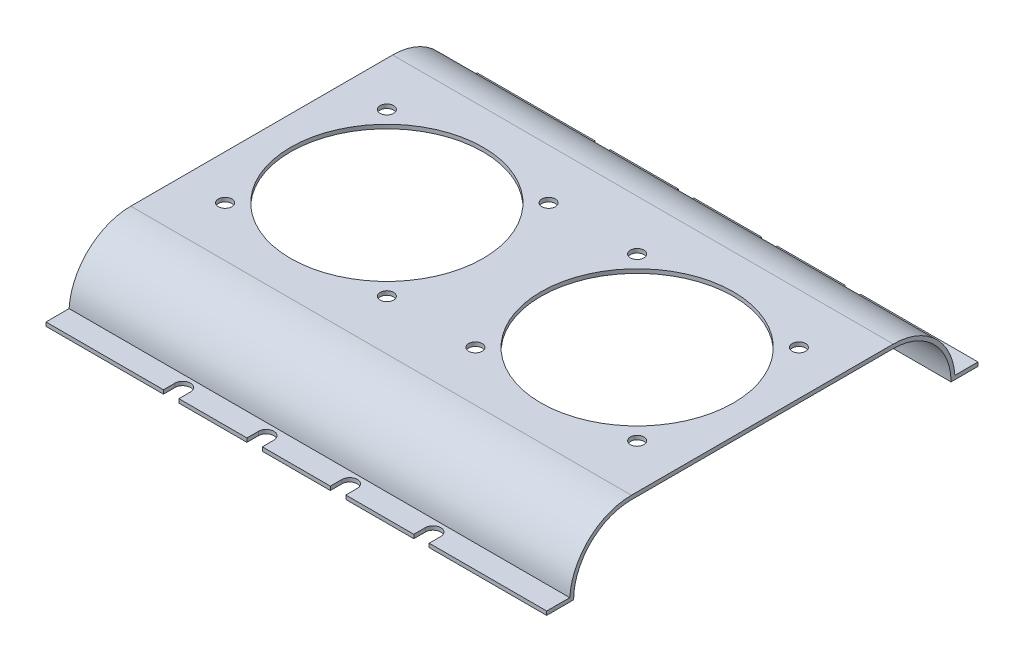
ISO-10303-21;
HEADER;
FILE_DESCRIPTION(('STEP AP214'),'2;1');
FILE_NAME('part.step','',(''),(''),'','','');
FILE_SCHEMA(('AUTOMOTIVE_DESIGN { 1 0 10303 214 1 1 1 1 }'));
ENDSEC;
DATA;
#1=APPLICATION_CONTEXT('core data for automotive mechanical design processes');
#2=APPLICATION_PROTOCOL_DEFINITION('international standard','automotive_design',2000,#1);
#3=PRODUCT_CONTEXT('',#1,'mechanical');
#4=PRODUCT('Part','Part','',(#3));
#5=PRODUCT_RELATED_PRODUCT_CATEGORY('part','',(#4));
#6=PRODUCT_DEFINITION_FORMATION('','',#4);
#7=PRODUCT_DEFINITION_CONTEXT('part definition',#1,'design');
#8=PRODUCT_DEFINITION('design','',#6,#7);
#9=PRODUCT_DEFINITION_SHAPE('','',#8);
#10=(LENGTH_UNIT() NAMED_UNIT(*) SI_UNIT(.MILLI.,.METRE.));
#11=(NAMED_UNIT(*) PLANE_ANGLE_UNIT() SI_UNIT($,.RADIAN.));
#12=(NAMED_UNIT(*) SI_UNIT($,.STERADIAN.) SOLID_ANGLE_UNIT());
#13=UNCERTAINTY_MEASURE_WITH_UNIT(LENGTH_MEASURE(1.E-05),#10,'distance_accuracy_value','');
#14=(GEOMETRIC_REPRESENTATION_CONTEXT(3) GLOBAL_UNCERTAINTY_ASSIGNED_CONTEXT((#13)) GLOBAL_UNIT_ASSIGNED_CONTEXT((#10,
#11,#12)) REPRESENTATION_CONTEXT('',''));
#15=CARTESIAN_POINT('',(0.,0.,0.));
#16=DIRECTION('',(0.,0.,1.));
#17=DIRECTION('',(1.,0.,0.));
#18=AXIS2_PLACEMENT_3D('',#15,#16,#17);
#19=CARTESIAN_POINT('',(0.,1.,-33.9997372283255));
#20=DIRECTION('',(0.,0.,1.));
#21=DIRECTION('',(1.,0.,0.));
#22=AXIS2_PLACEMENT_3D('',#19,#20,#21);
#23=PLANE('',#22);
#24=DIRECTION('',(1.,0.,0.));
#25=VECTOR('',#24,1.);
#26=CARTESIAN_POINT('',(0.,1.,-33.9997372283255));
#27=LINE('',#26,#25);
#28=CARTESIAN_POINT('',(0.,1.,-33.9997372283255));
#29=VERTEX_POINT('',#28);
#30=CARTESIAN_POINT('',(30.5,1.,-33.9997372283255));
#31=VERTEX_POINT('',#30);
#32=EDGE_CURVE('E356',#29,#31,#27,.T.);
#33=ORIENTED_EDGE('',*,*,#32,.T.);
#34=DIRECTION('',(0.,1.,0.));
#35=VECTOR('',#34,1.);
#36=CARTESIAN_POINT('',(30.5,-1.,-33.9997372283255));
#37=LINE('',#36,#35);
#38=CARTESIAN_POINT('',(30.5,0.,-33.9997372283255));
#39=VERTEX_POINT('',#38);
#40=EDGE_CURVE('E350',#39,#31,#37,.T.);
#41=ORIENTED_EDGE('',*,*,#40,.F.);
#42=DIRECTION('',(1.,0.,0.));
#43=VECTOR('',#42,1.);
#44=CARTESIAN_POINT('',(0.,0.,-33.9997372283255));
#45=LINE('',#44,#43);
#46=CARTESIAN_POINT('',(0.,0.,-33.9997372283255));
#47=VERTEX_POINT('',#46);
#48=EDGE_CURVE('E385',#47,#39,#45,.T.);
#49=ORIENTED_EDGE('',*,*,#48,.F.);
#50=DIRECTION('',(0.,-1.,0.));
#51=VECTOR('',#50,1.);
#52=CARTESIAN_POINT('',(0.,1.,-33.9997372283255));
#53=LINE('',#52,#51);
#54=EDGE_CURVE('E359',#29,#47,#53,.T.);
#55=ORIENTED_EDGE('',*,*,#54,.F.);
#56=EDGE_LOOP('',(#33,#41,#49,#55));
#57=FACE_BOUND('',#56,.T.);
#58=ADVANCED_FACE('F37',(#57),#23,.F.);
#59=CARTESIAN_POINT('',(34.5,0.,-33.9997372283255));
#60=VERTEX_POINT('',#59);
#61=CARTESIAN_POINT('',(52.168,0.,-33.9997372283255));
#62=VERTEX_POINT('',#61);
#63=EDGE_CURVE('E41',#60,#62,#45,.T.);
#64=ORIENTED_EDGE('',*,*,#63,.F.);
#65=DIRECTION('',(0.,1.,0.));
#66=VECTOR('',#65,1.);
#67=CARTESIAN_POINT('',(34.5,-1.,-33.9997372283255));
#68=LINE('',#67,#66);
#69=CARTESIAN_POINT('',(34.5,1.,-33.9997372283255));
#70=VERTEX_POINT('',#69);
#71=EDGE_CURVE('E337',#60,#70,#68,.T.);
#72=ORIENTED_EDGE('',*,*,#71,.T.);
#73=CARTESIAN_POINT('',(52.168,1.,-33.9997372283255));
#74=VERTEX_POINT('',#73);
#75=EDGE_CURVE('E348',#70,#74,#27,.T.);
#76=ORIENTED_EDGE('',*,*,#75,.T.);
#77=DIRECTION('',(0.,1.,0.));
#78=VECTOR('',#77,1.);
#79=CARTESIAN_POINT('',(52.168,-1.,-33.9997372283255));
#80=LINE('',#79,#78);
#81=EDGE_CURVE('E1182',#62,#74,#80,.T.);
#82=ORIENTED_EDGE('',*,*,#81,.F.);
#83=EDGE_LOOP('',(#64,#72,#76,#82));
#84=FACE_BOUND('',#83,.T.);
#85=ADVANCED_FACE('F346',(#84),#23,.F.);
#86=CARTESIAN_POINT('',(56.168,0.,-33.9997372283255));
#87=VERTEX_POINT('',#86);
#88=CARTESIAN_POINT('',(73.834,0.,-33.9997372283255));
#89=VERTEX_POINT('',#88);
#90=EDGE_CURVE('E365',#87,#89,#45,.T.);
#91=ORIENTED_EDGE('',*,*,#90,.F.);
#92=DIRECTION('',(0.,1.,0.));
#93=VECTOR('',#92,1.);
#94=CARTESIAN_POINT('',(56.168,-1.,-33.9997372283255));
#95=LINE('',#94,#93);
#96=CARTESIAN_POINT('',(56.168,1.,-33.9997372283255));
#97=VERTEX_POINT('',#96);
#98=EDGE_CURVE('E1184',#87,#97,#95,.T.);
#99=ORIENTED_EDGE('',*,*,#98,.T.);
#100=CARTESIAN_POINT('',(73.834,1.,-33.9997372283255));
#101=VERTEX_POINT('',#100);
#102=EDGE_CURVE('E357',#97,#101,#27,.T.);
#103=ORIENTED_EDGE('',*,*,#102,.T.);
#104=DIRECTION('',(0.,1.,0.));
#105=VECTOR('',#104,1.);
#106=CARTESIAN_POINT('',(73.834,-1.,-33.9997372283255));
#107=LINE('',#106,#105);
#108=EDGE_CURVE('E627',#89,#101,#107,.T.);
#109=ORIENTED_EDGE('',*,*,#108,.F.);
#110=EDGE_LOOP('',(#91,#99,#103,#109));
#111=FACE_BOUND('',#110,.T.);
#112=ADVANCED_FACE('F633',(#111),#23,.F.);
#113=CARTESIAN_POINT('',(77.834,0.,-33.9997372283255));
#114=VERTEX_POINT('',#113);
#115=CARTESIAN_POINT('',(95.5,0.,-33.9997372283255));
#116=VERTEX_POINT('',#115);
#117=EDGE_CURVE('E380',#114,#116,#45,.T.);
#118=ORIENTED_EDGE('',*,*,#117,.F.);
#119=DIRECTION('',(0.,1.,0.));
#120=VECTOR('',#119,1.);
#121=CARTESIAN_POINT('',(77.834,-1.,-33.9997372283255));
#122=LINE('',#121,#120);
#123=CARTESIAN_POINT('',(77.834,1.,-33.9997372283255));
#124=VERTEX_POINT('',#123);
#125=EDGE_CURVE('E635',#114,#124,#122,.T.);
#126=ORIENTED_EDGE('',*,*,#125,.T.);
#127=CARTESIAN_POINT('',(95.5,1.,-33.9997372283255));
#128=VERTEX_POINT('',#127);
#129=EDGE_CURVE('E361',#124,#128,#27,.T.);
#130=ORIENTED_EDGE('',*,*,#129,.T.);
#131=DIRECTION('',(0.,1.,0.));
#132=VECTOR('',#131,1.);
#133=CARTESIAN_POINT('',(95.5,-1.,-33.9997372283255));
#134=LINE('',#133,#132);
#135=EDGE_CURVE('E660',#116,#128,#134,.T.);
#136=ORIENTED_EDGE('',*,*,#135,.F.);
#137=EDGE_LOOP('',(#118,#126,#130,#136));
#138=FACE_BOUND('',#137,.T.);
#139=ADVANCED_FACE('F829',(#138),#23,.F.);
#140=CARTESIAN_POINT('',(0.,0.,78.0002627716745));
#141=DIRECTION('',(0.,0.,-1.));
#142=DIRECTION('',(-1.,0.,0.));
#143=AXIS2_PLACEMENT_3D('',#140,#141,#142);
#144=PLANE('',#143);
#145=DIRECTION('',(1.,0.,0.));
#146=VECTOR('',#145,1.);
#147=CARTESIAN_POINT('',(0.,0.999999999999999,78.0002627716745));
#148=LINE('',#147,#146);
#149=CARTESIAN_POINT('',(99.5,0.999999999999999,78.0002627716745));
#150=VERTEX_POINT('',#149);
#151=CARTESIAN_POINT('',(130.,0.999999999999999,78.0002627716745));
#152=VERTEX_POINT('',#151);
#153=EDGE_CURVE('E473',#150,#152,#148,.T.);
#154=ORIENTED_EDGE('',*,*,#153,.F.);
#155=DIRECTION('',(0.,1.,0.));
#156=VECTOR('',#155,1.);
#157=CARTESIAN_POINT('',(99.5,-1.,78.0002627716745));
#158=LINE('',#157,#156);
#159=CARTESIAN_POINT('',(99.5,0.,78.0002627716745));
#160=VERTEX_POINT('',#159);
#161=EDGE_CURVE('E686',#160,#150,#158,.T.);
#162=ORIENTED_EDGE('',*,*,#161,.F.);
#163=DIRECTION('',(1.,0.,0.));
#164=VECTOR('',#163,1.);
#165=CARTESIAN_POINT('',(0.,0.,78.0002627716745));
#166=LINE('',#165,#164);
#167=CARTESIAN_POINT('',(130.,0.,78.0002627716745));
#168=VERTEX_POINT('',#167);
#169=EDGE_CURVE('E477',#160,#168,#166,.T.);
#170=ORIENTED_EDGE('',*,*,#169,.T.);
#171=DIRECTION('',(0.,1.,0.));
#172=VECTOR('',#171,1.);
#173=CARTESIAN_POINT('',(130.,0.,78.0002627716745));
#174=LINE('',#173,#172);
#175=EDGE_CURVE('E486',#168,#152,#174,.T.);
#176=ORIENTED_EDGE('',*,*,#175,.T.);
#177=EDGE_LOOP('',(#154,#162,#170,#176));
#178=FACE_BOUND('',#177,.T.);
#179=ADVANCED_FACE('F792',(#178),#144,.F.);
#180=CARTESIAN_POINT('',(77.834,0.,78.0002627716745));
#181=VERTEX_POINT('',#180);
#182=CARTESIAN_POINT('',(95.5,0.,78.0002627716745));
#183=VERTEX_POINT('',#182);
#184=EDGE_CURVE('E475',#181,#183,#166,.T.);
#185=ORIENTED_EDGE('',*,*,#184,.T.);
#186=DIRECTION('',(0.,1.,0.));
#187=VECTOR('',#186,1.);
#188=CARTESIAN_POINT('',(95.5,-1.,78.0002627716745));
#189=LINE('',#188,#187);
#190=CARTESIAN_POINT('',(95.5,0.999999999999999,78.0002627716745));
#191=VERTEX_POINT('',#190);
#192=EDGE_CURVE('E688',#183,#191,#189,.T.);
#193=ORIENTED_EDGE('',*,*,#192,.T.);
#194=CARTESIAN_POINT('',(77.834,0.999999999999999,78.0002627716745));
#195=VERTEX_POINT('',#194);
#196=EDGE_CURVE('E453',#195,#191,#148,.T.);
#197=ORIENTED_EDGE('',*,*,#196,.F.);
#198=DIRECTION('',(0.,1.,0.));
#199=VECTOR('',#198,1.);
#200=CARTESIAN_POINT('',(77.834,-1.,78.0002627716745));
#201=LINE('',#200,#199);
#202=EDGE_CURVE('E712',#181,#195,#201,.T.);
#203=ORIENTED_EDGE('',*,*,#202,.F.);
#204=EDGE_LOOP('',(#185,#193,#197,#203));
#205=FACE_BOUND('',#204,.T.);
#206=ADVANCED_FACE('F782',(#205),#144,.F.);
#207=CARTESIAN_POINT('',(34.5,0.999999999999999,78.0002627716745));
#208=VERTEX_POINT('',#207);
#209=CARTESIAN_POINT('',(52.168,0.999999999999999,78.0002627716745));
#210=VERTEX_POINT('',#209);
#211=EDGE_CURVE('E452',#208,#210,#148,.T.);
#212=ORIENTED_EDGE('',*,*,#211,.F.);
#213=DIRECTION('',(0.,1.,0.));
#214=VECTOR('',#213,1.);
#215=CARTESIAN_POINT('',(34.5,-1.,78.0002627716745));
#216=LINE('',#215,#214);
#217=CARTESIAN_POINT('',(34.5,0.,78.0002627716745));
#218=VERTEX_POINT('',#217);
#219=EDGE_CURVE('E736',#218,#208,#216,.T.);
#220=ORIENTED_EDGE('',*,*,#219,.F.);
#221=CARTESIAN_POINT('',(52.168,0.,78.0002627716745));
#222=VERTEX_POINT('',#221);
#223=EDGE_CURVE('E474',#218,#222,#166,.T.);
#224=ORIENTED_EDGE('',*,*,#223,.T.);
#225=DIRECTION('',(0.,1.,0.));
#226=VECTOR('',#225,1.);
#227=CARTESIAN_POINT('',(52.168,-1.,78.0002627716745));
#228=LINE('',#227,#226);
#229=EDGE_CURVE('E541',#222,#210,#228,.T.);
#230=ORIENTED_EDGE('',*,*,#229,.T.);
#231=EDGE_LOOP('',(#212,#220,#224,#230));
#232=FACE_BOUND('',#231,.T.);
#233=ADVANCED_FACE('F548',(#232),#144,.F.);
#234=CARTESIAN_POINT('',(56.168,0.,78.0002627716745));
#235=VERTEX_POINT('',#234);
#236=CARTESIAN_POINT('',(73.834,0.,78.0002627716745));
#237=VERTEX_POINT('',#236);
#238=EDGE_CURVE('E454',#235,#237,#166,.T.);
#239=ORIENTED_EDGE('',*,*,#238,.T.);
#240=DIRECTION('',(0.,1.,0.));
#241=VECTOR('',#240,1.);
#242=CARTESIAN_POINT('',(73.834,-1.,78.0002627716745));
#243=LINE('',#242,#241);
#244=CARTESIAN_POINT('',(73.834,0.999999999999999,78.0002627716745));
#245=VERTEX_POINT('',#244);
#246=EDGE_CURVE('E714',#237,#245,#243,.T.);
#247=ORIENTED_EDGE('',*,*,#246,.T.);
#248=CARTESIAN_POINT('',(56.168,0.999999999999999,78.0002627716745));
#249=VERTEX_POINT('',#248);
#250=EDGE_CURVE('E448',#249,#245,#148,.T.);
#251=ORIENTED_EDGE('',*,*,#250,.F.);
#252=DIRECTION('',(0.,1.,0.));
#253=VECTOR('',#252,1.);
#254=CARTESIAN_POINT('',(56.168,-1.,78.0002627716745));
#255=LINE('',#254,#253);
#256=EDGE_CURVE('E550',#235,#249,#255,.T.);
#257=ORIENTED_EDGE('',*,*,#256,.F.);
#258=EDGE_LOOP('',(#239,#247,#251,#257));
#259=FACE_BOUND('',#258,.T.);
#260=ADVANCED_FACE('F764',(#259),#144,.F.);
#261=CARTESIAN_POINT('',(0.,0.,-11.9997372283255));
#262=DIRECTION('',(1.,0.,0.));
#263=DIRECTION('',(0.,0.,-1.));
#264=AXIS2_PLACEMENT_3D('',#261,#262,#263);
#265=CYLINDRICAL_SURFACE('',#264,16.0312195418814);
#266=CARTESIAN_POINT('',(130.,0.,-11.9997372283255));
#267=DIRECTION('',(1.,0.,0.));
#268=DIRECTION('',(0.,0.,1.));
#269=AXIS2_PLACEMENT_3D('',#266,#267,#268);
#270=CIRCLE('',#269,16.0312195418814);
#271=CARTESIAN_POINT('',(130.,1.,-27.9997372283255));
#272=VERTEX_POINT('',#271);
#273=CARTESIAN_POINT('',(130.,16.0312195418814,-11.9997372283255));
#274=VERTEX_POINT('',#273);
#275=EDGE_CURVE('E447',#272,#274,#270,.T.);
#276=ORIENTED_EDGE('',*,*,#275,.F.);
#277=DIRECTION('',(1.,0.,0.));
#278=VECTOR('',#277,1.);
#279=CARTESIAN_POINT('',(0.,1.,-27.9997372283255));
#280=LINE('',#279,#278);
#281=CARTESIAN_POINT('',(0.,1.,-27.9997372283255));
#282=VERTEX_POINT('',#281);
#283=EDGE_CURVE('E398',#282,#272,#280,.T.);
#284=ORIENTED_EDGE('',*,*,#283,.F.);
#285=CARTESIAN_POINT('',(0.,0.,-11.9997372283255));
#286=DIRECTION('',(1.,0.,0.));
#287=DIRECTION('',(0.,0.,1.));
#288=AXIS2_PLACEMENT_3D('',#285,#286,#287);
#289=CIRCLE('',#288,16.0312195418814);
#290=CARTESIAN_POINT('',(0.,16.0312195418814,-11.9997372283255));
#291=VERTEX_POINT('',#290);
#292=EDGE_CURVE('E437',#282,#291,#289,.T.);
#293=ORIENTED_EDGE('',*,*,#292,.T.);
#294=DIRECTION('',(1.,0.,0.));
#295=VECTOR('',#294,1.);
#296=CARTESIAN_POINT('',(0.,16.0312195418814,-11.9997372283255));
#297=LINE('',#296,#295);
#298=EDGE_CURVE('E1238',#291,#274,#297,.T.);
#299=ORIENTED_EDGE('',*,*,#298,.T.);
#300=EDGE_LOOP('',(#276,#284,#293,#299));
#301=FACE_BOUND('',#300,.T.);
#302=ADVANCED_FACE('F1227',(#301),#265,.T.);
#303=CARTESIAN_POINT('',(0.,0.,-28.0309567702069));
#304=DIRECTION('',(0.,-0.999953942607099,0.00959753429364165));
#305=DIRECTION('',(0.,-0.00959753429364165,-0.999953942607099));
#306=AXIS2_PLACEMENT_3D('',#303,#304,#305);
#307=PLANE('',#306);
#308=DIRECTION('',(0.,-0.00959753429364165,-0.9999539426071));
#309=VECTOR('',#308,1.);
#310=CARTESIAN_POINT('',(0.,0.,-28.0309567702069));
#311=LINE('',#310,#309);
#312=CARTESIAN_POINT('',(0.,0.00989765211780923,-26.9997339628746));
#313=VERTEX_POINT('',#312);
#314=CARTESIAN_POINT('',(0.,0.00029964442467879,-27.9997372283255));
#315=VERTEX_POINT('',#314);
#316=EDGE_CURVE('E424',#313,#315,#311,.T.);
#317=ORIENTED_EDGE('',*,*,#316,.T.);
#318=DIRECTION('',(1.,0.,0.));
#319=VECTOR('',#318,1.);
#320=CARTESIAN_POINT('',(0.,0.000299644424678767,-27.9997372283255));
#321=LINE('',#320,#319);
#322=CARTESIAN_POINT('',(130.,0.000299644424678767,-27.9997372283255));
#323=VERTEX_POINT('',#322);
#324=EDGE_CURVE('E12',#315,#323,#321,.T.);
#325=ORIENTED_EDGE('',*,*,#324,.T.);
#326=DIRECTION('',(0.,-0.00959753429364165,-0.9999539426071));
#327=VECTOR('',#326,1.);
#328=CARTESIAN_POINT('',(130.,0.,-28.0309567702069));
#329=LINE('',#328,#327);
#330=CARTESIAN_POINT('',(130.,0.00989765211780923,-26.9997339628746));
#331=VERTEX_POINT('',#330);
#332=EDGE_CURVE('E425',#331,#323,#329,.T.);
#333=ORIENTED_EDGE('',*,*,#332,.F.);
#334=DIRECTION('',(1.,0.,0.));
#335=VECTOR('',#334,1.);
#336=CARTESIAN_POINT('',(0.,0.00989765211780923,-26.9997339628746));
#337=LINE('',#336,#335);
#338=EDGE_CURVE('E421',#313,#331,#337,.T.);
#339=ORIENTED_EDGE('',*,*,#338,.F.);
#340=EDGE_LOOP('',(#317,#325,#333,#339));
#341=FACE_BOUND('',#340,.T.);
#342=ADVANCED_FACE('F1210',(#341),#307,.T.);
#343=CARTESIAN_POINT('',(130.,0.,0.));
#344=DIRECTION('',(1.,0.,0.));
#345=DIRECTION('',(0.,0.,-1.));
#346=AXIS2_PLACEMENT_3D('',#343,#344,#345);
#347=PLANE('',#346);
#348=DIRECTION('',(0.,0.,-1.));
#349=VECTOR('',#348,1.);
#350=CARTESIAN_POINT('',(130.,1.,-27.9997372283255));
#351=LINE('',#350,#349);
#352=CARTESIAN_POINT('',(130.,1.,-33.9997372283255));
#353=VERTEX_POINT('',#352);
#354=EDGE_CURVE('E585',#272,#353,#351,.T.);
#355=ORIENTED_EDGE('',*,*,#354,.F.);
#356=ORIENTED_EDGE('',*,*,#275,.T.);
#357=DIRECTION('',(0.,0.,1.));
#358=VECTOR('',#357,1.);
#359=CARTESIAN_POINT('',(130.,16.0312195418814,-11.9997372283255));
#360=LINE('',#359,#358);
#361=CARTESIAN_POINT('',(130.,16.0312195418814,56.0002627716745));
#362=VERTEX_POINT('',#361);
#363=EDGE_CURVE('E1242',#274,#362,#360,.T.);
#364=ORIENTED_EDGE('',*,*,#363,.T.);
#365=CARTESIAN_POINT('',(130.,0.,56.0002627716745));
#366=DIRECTION('',(-1.,0.,0.));
#367=DIRECTION('',(0.,0.,-1.));
#368=AXIS2_PLACEMENT_3D('',#365,#366,#367);
#369=CIRCLE('',#368,16.0312195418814);
#370=CARTESIAN_POINT('',(130.,1.,72.0002627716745));
#371=VERTEX_POINT('',#370);
#372=EDGE_CURVE('E1270',#371,#362,#369,.T.);
#373=ORIENTED_EDGE('',*,*,#372,.F.);
#374=DIRECTION('',(0.,0.,-1.));
#375=VECTOR('',#374,1.);
#376=CARTESIAN_POINT('',(130.,0.999999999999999,78.0002627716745));
#377=LINE('',#376,#375);
#378=EDGE_CURVE('E506',#152,#371,#377,.T.);
#379=ORIENTED_EDGE('',*,*,#378,.F.);
#380=ORIENTED_EDGE('',*,*,#175,.F.);
#381=DIRECTION('',(0.,0.,1.));
#382=VECTOR('',#381,1.);
#383=CARTESIAN_POINT('',(130.,0.,72.0002627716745));
#384=LINE('',#383,#382);
#385=CARTESIAN_POINT('',(130.,0.,71.0002627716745));
#386=VERTEX_POINT('',#385);
#387=EDGE_CURVE('E513',#386,#168,#384,.T.);
#388=ORIENTED_EDGE('',*,*,#387,.F.);
#389=CARTESIAN_POINT('',(130.,0.,56.0002627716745));
#390=DIRECTION('',(1.,0.,0.));
#391=DIRECTION('',(0.,0.,-1.));
#392=AXIS2_PLACEMENT_3D('',#389,#390,#391);
#393=CIRCLE('',#392,15.);
#394=CARTESIAN_POINT('',(130.,15.,56.0002627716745));
#395=VERTEX_POINT('',#394);
#396=EDGE_CURVE('E498',#395,#386,#393,.T.);
#397=ORIENTED_EDGE('',*,*,#396,.F.);
#398=DIRECTION('',(0.,0.,-1.));
#399=VECTOR('',#398,1.);
#400=CARTESIAN_POINT('',(130.,15.,-11.9997372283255));
#401=LINE('',#400,#399);
#402=CARTESIAN_POINT('',(130.,15.,-11.9997372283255));
#403=VERTEX_POINT('',#402);
#404=EDGE_CURVE('E1252',#395,#403,#401,.T.);
#405=ORIENTED_EDGE('',*,*,#404,.T.);
#406=CARTESIAN_POINT('',(130.,0.,-11.9997372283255));
#407=DIRECTION('',(-1.,0.,0.));
#408=DIRECTION('',(0.,0.,1.));
#409=AXIS2_PLACEMENT_3D('',#406,#407,#408);
#410=CIRCLE('',#409,15.);
#411=EDGE_CURVE('E418',#403,#331,#410,.T.);
#412=ORIENTED_EDGE('',*,*,#411,.T.);
#413=ORIENTED_EDGE('',*,*,#332,.T.);
#414=DIRECTION('',(0.,1.,0.));
#415=VECTOR('',#414,1.);
#416=CARTESIAN_POINT('',(130.,1.,-27.9997372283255));
#417=LINE('',#416,#415);
#418=CARTESIAN_POINT('',(130.,0.,-27.9997372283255));
#419=VERTEX_POINT('',#418);
#420=EDGE_CURVE('E411',#419,#323,#417,.T.);
#421=ORIENTED_EDGE('',*,*,#420,.F.);
#422=DIRECTION('',(0.,0.,1.));
#423=VECTOR('',#422,1.);
#424=CARTESIAN_POINT('',(130.,0.,-27.9997372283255));
#425=LINE('',#424,#423);
#426=CARTESIAN_POINT('',(130.,0.,-33.9997372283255));
#427=VERTEX_POINT('',#426);
#428=EDGE_CURVE('E393',#427,#419,#425,.T.);
#429=ORIENTED_EDGE('',*,*,#428,.F.);
#430=DIRECTION('',(0.,-1.,0.));
#431=VECTOR('',#430,1.);
#432=CARTESIAN_POINT('',(130.,1.,-33.9997372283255));
#433=LINE('',#432,#431);
#434=EDGE_CURVE('E601',#353,#427,#433,.T.);
#435=ORIENTED_EDGE('',*,*,#434,.F.);
#436=EDGE_LOOP('',(#355,#356,#364,#373,#379,#380,#388,#397,#405,#412,#413,#421,#429,#435));
#437=FACE_BOUND('',#436,.T.);
#438=ADVANCED_FACE('F39',(#437),#347,.T.);
#439=CARTESIAN_POINT('',(0.,0.,0.));
#440=DIRECTION('',(1.,0.,0.));
#441=DIRECTION('',(0.,0.,-1.));
#442=AXIS2_PLACEMENT_3D('',#439,#440,#441);
#443=PLANE('',#442);
#444=DIRECTION('',(0.,1.,0.));
#445=VECTOR('',#444,1.);
#446=CARTESIAN_POINT('',(0.,1.,-27.9997372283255));
#447=LINE('',#446,#445);
#448=CARTESIAN_POINT('',(0.,0.,-27.9997372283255));
#449=VERTEX_POINT('',#448);
#450=EDGE_CURVE('E403',#449,#315,#447,.T.);
#451=ORIENTED_EDGE('',*,*,#450,.T.);
#452=ORIENTED_EDGE('',*,*,#316,.F.);
#453=CARTESIAN_POINT('',(0.,0.,-11.9997372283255));
#454=DIRECTION('',(-1.,0.,0.));
#455=DIRECTION('',(0.,0.,1.));
#456=AXIS2_PLACEMENT_3D('',#453,#454,#455);
#457=CIRCLE('',#456,15.);
#458=CARTESIAN_POINT('',(0.,15.,-11.9997372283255));
#459=VERTEX_POINT('',#458);
#460=EDGE_CURVE('E414',#459,#313,#457,.T.);
#461=ORIENTED_EDGE('',*,*,#460,.F.);
#462=DIRECTION('',(0.,0.,-1.));
#463=VECTOR('',#462,1.);
#464=CARTESIAN_POINT('',(0.,15.,-11.9997372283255));
#465=LINE('',#464,#463);
#466=CARTESIAN_POINT('',(0.,15.,56.0002627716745));
#467=VERTEX_POINT('',#466);
#468=EDGE_CURVE('E1249',#467,#459,#465,.T.);
#469=ORIENTED_EDGE('',*,*,#468,.F.);
#470=CARTESIAN_POINT('',(0.,0.,56.0002627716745));
#471=DIRECTION('',(1.,0.,0.));
#472=DIRECTION('',(0.,0.,-1.));
#473=AXIS2_PLACEMENT_3D('',#470,#471,#472);
#474=CIRCLE('',#473,15.);
#475=CARTESIAN_POINT('',(0.,0.,71.0002627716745));
#476=VERTEX_POINT('',#475);
#477=EDGE_CURVE('E492',#467,#476,#474,.T.);
#478=ORIENTED_EDGE('',*,*,#477,.T.);
#479=DIRECTION('',(0.,0.,1.));
#480=VECTOR('',#479,1.);
#481=CARTESIAN_POINT('',(0.,0.,72.0002627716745));
#482=LINE('',#481,#480);
#483=CARTESIAN_POINT('',(0.,0.,78.0002627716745));
#484=VERTEX_POINT('',#483);
#485=EDGE_CURVE('E511',#476,#484,#482,.T.);
#486=ORIENTED_EDGE('',*,*,#485,.T.);
#487=DIRECTION('',(0.,1.,0.));
#488=VECTOR('',#487,1.);
#489=CARTESIAN_POINT('',(0.,0.,78.0002627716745));
#490=LINE('',#489,#488);
#491=CARTESIAN_POINT('',(0.,0.999999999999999,78.0002627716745));
#492=VERTEX_POINT('',#491);
#493=EDGE_CURVE('E462',#484,#492,#490,.T.);
#494=ORIENTED_EDGE('',*,*,#493,.T.);
#495=DIRECTION('',(0.,0.,-1.));
#496=VECTOR('',#495,1.);
#497=CARTESIAN_POINT('',(0.,0.999999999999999,78.0002627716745));
#498=LINE('',#497,#496);
#499=CARTESIAN_POINT('',(0.,0.999999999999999,72.0002627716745));
#500=VERTEX_POINT('',#499);
#501=EDGE_CURVE('E47',#492,#500,#498,.T.);
#502=ORIENTED_EDGE('',*,*,#501,.T.);
#503=CARTESIAN_POINT('',(0.,0.,56.0002627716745));
#504=DIRECTION('',(-1.,0.,0.));
#505=DIRECTION('',(0.,0.,-1.));
#506=AXIS2_PLACEMENT_3D('',#503,#504,#505);
#507=CIRCLE('',#506,16.0312195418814);
#508=CARTESIAN_POINT('',(0.,16.0312195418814,56.0002627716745));
#509=VERTEX_POINT('',#508);
#510=EDGE_CURVE('E1277',#500,#509,#507,.T.);
#511=ORIENTED_EDGE('',*,*,#510,.T.);
#512=DIRECTION('',(0.,0.,1.));
#513=VECTOR('',#512,1.);
#514=CARTESIAN_POINT('',(0.,16.0312195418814,-11.9997372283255));
#515=LINE('',#514,#513);
#516=EDGE_CURVE('E1248',#291,#509,#515,.T.);
#517=ORIENTED_EDGE('',*,*,#516,.F.);
#518=ORIENTED_EDGE('',*,*,#292,.F.);
#519=DIRECTION('',(0.,0.,-1.));
#520=VECTOR('',#519,1.);
#521=CARTESIAN_POINT('',(0.,1.,-27.9997372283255));
#522=LINE('',#521,#520);
#523=EDGE_CURVE('E583',#282,#29,#522,.T.);
#524=ORIENTED_EDGE('',*,*,#523,.T.);
#525=ORIENTED_EDGE('',*,*,#54,.T.);
#526=DIRECTION('',(0.,0.,1.));
#527=VECTOR('',#526,1.);
#528=CARTESIAN_POINT('',(0.,0.,-27.9997372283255));
#529=LINE('',#528,#527);
#530=EDGE_CURVE('E387',#47,#449,#529,.T.);
#531=ORIENTED_EDGE('',*,*,#530,.T.);
#532=EDGE_LOOP('',(#451,#452,#461,#469,#478,#486,#494,#502,#511,#517,#518,#524,#525,#531));
#533=FACE_BOUND('',#532,.T.);
#534=ADVANCED_FACE('F1204',(#533),#443,.F.);
#535=CARTESIAN_POINT('',(30.5,0.,78.0002627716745));
#536=VERTEX_POINT('',#535);
#537=EDGE_CURVE('E480',#484,#536,#166,.T.);
#538=ORIENTED_EDGE('',*,*,#537,.T.);
#539=DIRECTION('',(0.,1.,0.));
#540=VECTOR('',#539,1.);
#541=CARTESIAN_POINT('',(30.5,-1.,78.0002627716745));
#542=LINE('',#541,#540);
#543=CARTESIAN_POINT('',(30.5,0.999999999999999,78.0002627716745));
#544=VERTEX_POINT('',#543);
#545=EDGE_CURVE('E738',#536,#544,#542,.T.);
#546=ORIENTED_EDGE('',*,*,#545,.T.);
#547=EDGE_CURVE('E460',#492,#544,#148,.T.);
#548=ORIENTED_EDGE('',*,*,#547,.F.);
#549=ORIENTED_EDGE('',*,*,#493,.F.);
#550=EDGE_LOOP('',(#538,#546,#548,#549));
#551=FACE_BOUND('',#550,.T.);
#552=ADVANCED_FACE('F799',(#551),#144,.F.);
#553=CARTESIAN_POINT('',(0.,0.,72.0002627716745));
#554=DIRECTION('',(0.,1.,0.));
#555=DIRECTION('',(0.,0.,1.));
#556=AXIS2_PLACEMENT_3D('',#553,#554,#555);
#557=PLANE('',#556);
#558=ORIENTED_EDGE('',*,*,#169,.F.);
#559=DIRECTION('',(0.,0.,-1.));
#560=VECTOR('',#559,1.);
#561=CARTESIAN_POINT('',(99.5,0.,72.0002627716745));
#562=LINE('',#561,#560);
#563=CARTESIAN_POINT('',(99.5,0.,75.0002627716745));
#564=VERTEX_POINT('',#563);
#565=EDGE_CURVE('E695',#160,#564,#562,.T.);
#566=ORIENTED_EDGE('',*,*,#565,.T.);
#567=CARTESIAN_POINT('',(97.5,0.,75.0002627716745));
#568=DIRECTION('',(0.,1.,0.));
#569=DIRECTION('',(0.,0.,1.));
#570=AXIS2_PLACEMENT_3D('',#567,#568,#569);
#571=CIRCLE('',#570,2.);
#572=CARTESIAN_POINT('',(95.5,0.,75.0002627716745));
#573=VERTEX_POINT('',#572);
#574=EDGE_CURVE('E698',#564,#573,#571,.T.);
#575=ORIENTED_EDGE('',*,*,#574,.T.);
#576=DIRECTION('',(0.,0.,1.));
#577=VECTOR('',#576,1.);
#578=CARTESIAN_POINT('',(95.5,0.,72.0002627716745));
#579=LINE('',#578,#577);
#580=EDGE_CURVE('E685',#573,#183,#579,.T.);
#581=ORIENTED_EDGE('',*,*,#580,.T.);
#582=ORIENTED_EDGE('',*,*,#184,.F.);
#583=DIRECTION('',(0.,0.,-1.));
#584=VECTOR('',#583,1.);
#585=CARTESIAN_POINT('',(77.834,0.,72.0002627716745));
#586=LINE('',#585,#584);
#587=CARTESIAN_POINT('',(77.834,0.,75.0002627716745));
#588=VERTEX_POINT('',#587);
#589=EDGE_CURVE('E721',#181,#588,#586,.T.);
#590=ORIENTED_EDGE('',*,*,#589,.T.);
#591=CARTESIAN_POINT('',(75.834,0.,75.0002627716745));
#592=DIRECTION('',(0.,1.,0.));
#593=DIRECTION('',(0.,0.,1.));
#594=AXIS2_PLACEMENT_3D('',#591,#592,#593);
#595=CIRCLE('',#594,2.);
#596=CARTESIAN_POINT('',(73.834,0.,75.0002627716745));
#597=VERTEX_POINT('',#596);
#598=EDGE_CURVE('E724',#588,#597,#595,.T.);
#599=ORIENTED_EDGE('',*,*,#598,.T.);
#600=DIRECTION('',(0.,0.,1.));
#601=VECTOR('',#600,1.);
#602=CARTESIAN_POINT('',(73.834,0.,72.0002627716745));
#603=LINE('',#602,#601);
#604=EDGE_CURVE('E711',#597,#237,#603,.T.);
#605=ORIENTED_EDGE('',*,*,#604,.T.);
#606=ORIENTED_EDGE('',*,*,#238,.F.);
#607=DIRECTION('',(0.,0.,-1.));
#608=VECTOR('',#607,1.);
#609=CARTESIAN_POINT('',(56.168,0.,72.0002627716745));
#610=LINE('',#609,#608);
#611=CARTESIAN_POINT('',(56.168,0.,75.0002627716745));
#612=VERTEX_POINT('',#611);
#613=EDGE_CURVE('E559',#235,#612,#610,.T.);
#614=ORIENTED_EDGE('',*,*,#613,.T.);
#615=CARTESIAN_POINT('',(54.168,0.,75.0002627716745));
#616=DIRECTION('',(0.,1.,0.));
#617=DIRECTION('',(0.,0.,1.));
#618=AXIS2_PLACEMENT_3D('',#615,#616,#617);
#619=CIRCLE('',#618,2.);
#620=CARTESIAN_POINT('',(52.168,0.,75.0002627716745));
#621=VERTEX_POINT('',#620);
#622=EDGE_CURVE('E562',#612,#621,#619,.T.);
#623=ORIENTED_EDGE('',*,*,#622,.T.);
#624=DIRECTION('',(0.,0.,1.));
#625=VECTOR('',#624,1.);
#626=CARTESIAN_POINT('',(52.168,0.,72.0002627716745));
#627=LINE('',#626,#625);
#628=EDGE_CURVE('E557',#621,#222,#627,.T.);
#629=ORIENTED_EDGE('',*,*,#628,.T.);
#630=ORIENTED_EDGE('',*,*,#223,.F.);
#631=DIRECTION('',(0.,0.,-1.));
#632=VECTOR('',#631,1.);
#633=CARTESIAN_POINT('',(34.5,0.,72.0002627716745));
#634=LINE('',#633,#632);
#635=CARTESIAN_POINT('',(34.5,0.,75.0002627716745));
#636=VERTEX_POINT('',#635);
#637=EDGE_CURVE('E745',#218,#636,#634,.T.);
#638=ORIENTED_EDGE('',*,*,#637,.T.);
#639=CARTESIAN_POINT('',(32.5,0.,75.0002627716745));
#640=DIRECTION('',(0.,1.,0.));
#641=DIRECTION('',(0.,0.,1.));
#642=AXIS2_PLACEMENT_3D('',#639,#640,#641);
#643=CIRCLE('',#642,2.);
#644=CARTESIAN_POINT('',(30.5,0.,75.0002627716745));
#645=VERTEX_POINT('',#644);
#646=EDGE_CURVE('E748',#636,#645,#643,.T.);
#647=ORIENTED_EDGE('',*,*,#646,.T.);
#648=DIRECTION('',(0.,0.,1.));
#649=VECTOR('',#648,1.);
#650=CARTESIAN_POINT('',(30.5,0.,72.0002627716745));
#651=LINE('',#650,#649);
#652=EDGE_CURVE('E735',#645,#536,#651,.T.);
#653=ORIENTED_EDGE('',*,*,#652,.T.);
#654=ORIENTED_EDGE('',*,*,#537,.F.);
#655=ORIENTED_EDGE('',*,*,#485,.F.);
#656=DIRECTION('',(1.,0.,0.));
#657=VECTOR('',#656,1.);
#658=CARTESIAN_POINT('',(0.,0.,71.0002627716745));
#659=LINE('',#658,#657);
#660=EDGE_CURVE('E1275',#476,#386,#659,.T.);
#661=ORIENTED_EDGE('',*,*,#660,.T.);
#662=ORIENTED_EDGE('',*,*,#387,.T.);
#663=EDGE_LOOP('',(#558,#566,#575,#581,#582,#590,#599,#605,#606,#614,#623,#629,#630,#638,#647,
#653,#654,#655,#661,#662));
#664=FACE_BOUND('',#663,.T.);
#665=ADVANCED_FACE('F769',(#664),#557,.F.);
#666=CARTESIAN_POINT('',(0.,0.999999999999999,78.0002627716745));
#667=DIRECTION('',(0.,-1.,0.));
#668=DIRECTION('',(0.,0.,-1.));
#669=AXIS2_PLACEMENT_3D('',#666,#667,#668);
#670=PLANE('',#669);
#671=CARTESIAN_POINT('',(97.5,0.999999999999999,75.0002627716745));
#672=DIRECTION('',(0.,1.,0.));
#673=DIRECTION('',(0.,0.,-1.));
#674=AXIS2_PLACEMENT_3D('',#671,#672,#673);
#675=CIRCLE('',#674,2.);
#676=CARTESIAN_POINT('',(99.5,0.999999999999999,75.0002627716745));
#677=VERTEX_POINT('',#676);
#678=CARTESIAN_POINT('',(95.5,0.999999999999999,75.0002627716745));
#679=VERTEX_POINT('',#678);
#680=EDGE_CURVE('E675',#677,#679,#675,.T.);
#681=ORIENTED_EDGE('',*,*,#680,.F.);
#682=DIRECTION('',(0.,0.,-1.));
#683=VECTOR('',#682,1.);
#684=CARTESIAN_POINT('',(99.5,0.999999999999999,78.0002627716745));
#685=LINE('',#684,#683);
#686=EDGE_CURVE('E679',#150,#677,#685,.T.);
#687=ORIENTED_EDGE('',*,*,#686,.F.);
#688=ORIENTED_EDGE('',*,*,#153,.T.);
#689=ORIENTED_EDGE('',*,*,#378,.T.);
#690=DIRECTION('',(1.,0.,0.));
#691=VECTOR('',#690,1.);
#692=CARTESIAN_POINT('',(0.,0.999999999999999,72.0002627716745));
#693=LINE('',#692,#691);
#694=EDGE_CURVE('E508',#500,#371,#693,.T.);
#695=ORIENTED_EDGE('',*,*,#694,.F.);
#696=ORIENTED_EDGE('',*,*,#501,.F.);
#697=ORIENTED_EDGE('',*,*,#547,.T.);
#698=DIRECTION('',(0.,0.,1.));
#699=VECTOR('',#698,1.);
#700=CARTESIAN_POINT('',(30.5,0.999999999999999,75.0002627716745));
#701=LINE('',#700,#699);
#702=CARTESIAN_POINT('',(30.5,0.999999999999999,75.0002627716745));
#703=VERTEX_POINT('',#702);
#704=EDGE_CURVE('E729',#703,#544,#701,.T.);
#705=ORIENTED_EDGE('',*,*,#704,.F.);
#706=CARTESIAN_POINT('',(32.5,0.999999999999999,75.0002627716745));
#707=DIRECTION('',(0.,1.,0.));
#708=DIRECTION('',(0.,0.,-1.));
#709=AXIS2_PLACEMENT_3D('',#706,#707,#708);
#710=CIRCLE('',#709,2.);
#711=CARTESIAN_POINT('',(34.5,0.999999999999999,75.0002627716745));
#712=VERTEX_POINT('',#711);
#713=EDGE_CURVE('E727',#712,#703,#710,.T.);
#714=ORIENTED_EDGE('',*,*,#713,.F.);
#715=DIRECTION('',(0.,0.,-1.));
#716=VECTOR('',#715,1.);
#717=CARTESIAN_POINT('',(34.5,0.999999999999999,75.0002627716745));
#718=LINE('',#717,#716);
#719=EDGE_CURVE('E533',#208,#712,#718,.T.);
#720=ORIENTED_EDGE('',*,*,#719,.F.);
#721=ORIENTED_EDGE('',*,*,#211,.T.);
#722=DIRECTION('',(0.,0.,1.));
#723=VECTOR('',#722,1.);
#724=CARTESIAN_POINT('',(52.168,0.999999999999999,75.0002627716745));
#725=LINE('',#724,#723);
#726=CARTESIAN_POINT('',(52.168,0.999999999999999,75.0002627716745));
#727=VERTEX_POINT('',#726);
#728=EDGE_CURVE('E530',#727,#210,#725,.T.);
#729=ORIENTED_EDGE('',*,*,#728,.F.);
#730=CARTESIAN_POINT('',(54.168,0.999999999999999,75.0002627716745));
#731=DIRECTION('',(0.,1.,0.));
#732=DIRECTION('',(0.,0.,-1.));
#733=AXIS2_PLACEMENT_3D('',#730,#731,#732);
#734=CIRCLE('',#733,2.);
#735=CARTESIAN_POINT('',(56.168,0.999999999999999,75.0002627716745));
#736=VERTEX_POINT('',#735);
#737=EDGE_CURVE('E546',#736,#727,#734,.T.);
#738=ORIENTED_EDGE('',*,*,#737,.F.);
#739=DIRECTION('',(0.,0.,-1.));
#740=VECTOR('',#739,1.);
#741=CARTESIAN_POINT('',(56.168,0.999999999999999,78.0002627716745));
#742=LINE('',#741,#740);
#743=EDGE_CURVE('E545',#249,#736,#742,.T.);
#744=ORIENTED_EDGE('',*,*,#743,.F.);
#745=ORIENTED_EDGE('',*,*,#250,.T.);
#746=DIRECTION('',(0.,0.,1.));
#747=VECTOR('',#746,1.);
#748=CARTESIAN_POINT('',(73.834,0.999999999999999,75.0002627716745));
#749=LINE('',#748,#747);
#750=CARTESIAN_POINT('',(73.834,0.999999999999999,75.0002627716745));
#751=VERTEX_POINT('',#750);
#752=EDGE_CURVE('E703',#751,#245,#749,.T.);
#753=ORIENTED_EDGE('',*,*,#752,.F.);
#754=CARTESIAN_POINT('',(75.834,0.999999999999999,75.0002627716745));
#755=DIRECTION('',(0.,1.,0.));
#756=DIRECTION('',(0.,0.,-1.));
#757=AXIS2_PLACEMENT_3D('',#754,#755,#756);
#758=CIRCLE('',#757,2.);
#759=CARTESIAN_POINT('',(77.834,0.999999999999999,75.0002627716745));
#760=VERTEX_POINT('',#759);
#761=EDGE_CURVE('E701',#760,#751,#758,.T.);
#762=ORIENTED_EDGE('',*,*,#761,.F.);
#763=DIRECTION('',(0.,0.,-1.));
#764=VECTOR('',#763,1.);
#765=CARTESIAN_POINT('',(77.834,0.999999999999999,78.0002627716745));
#766=LINE('',#765,#764);
#767=EDGE_CURVE('E705',#195,#760,#766,.T.);
#768=ORIENTED_EDGE('',*,*,#767,.F.);
#769=ORIENTED_EDGE('',*,*,#196,.T.);
#770=DIRECTION('',(0.,0.,1.));
#771=VECTOR('',#770,1.);
#772=CARTESIAN_POINT('',(95.5,0.999999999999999,75.0002627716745));
#773=LINE('',#772,#771);
#774=EDGE_CURVE('E677',#679,#191,#773,.T.);
#775=ORIENTED_EDGE('',*,*,#774,.F.);
#776=EDGE_LOOP('',(#681,#687,#688,#689,#695,#696,#697,#705,#714,#720,#721,#729,#738,#744,#745,
#753,#762,#768,#769,#775));
#777=FACE_BOUND('',#776,.T.);
#778=ADVANCED_FACE('F528',(#777),#670,.F.);
#779=CARTESIAN_POINT('',(0.,0.,56.0002627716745));
#780=DIRECTION('',(1.,0.,0.));
#781=DIRECTION('',(0.,0.,-1.));
#782=AXIS2_PLACEMENT_3D('',#779,#780,#781);
#783=CYLINDRICAL_SURFACE('',#782,16.0312195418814);
#784=ORIENTED_EDGE('',*,*,#510,.F.);
#785=ORIENTED_EDGE('',*,*,#694,.T.);
#786=ORIENTED_EDGE('',*,*,#372,.T.);
#787=DIRECTION('',(1.,0.,0.));
#788=VECTOR('',#787,1.);
#789=CARTESIAN_POINT('',(0.,16.0312195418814,56.0002627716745));
#790=LINE('',#789,#788);
#791=EDGE_CURVE('E1247',#509,#362,#790,.T.);
#792=ORIENTED_EDGE('',*,*,#791,.F.);
#793=EDGE_LOOP('',(#784,#785,#786,#792));
#794=FACE_BOUND('',#793,.T.);
#795=ADVANCED_FACE('F1212',(#794),#783,.T.);
#796=CARTESIAN_POINT('',(0.,0.,56.0002627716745));
#797=DIRECTION('',(1.,0.,0.));
#798=DIRECTION('',(0.,0.,-1.));
#799=AXIS2_PLACEMENT_3D('',#796,#797,#798);
#800=CYLINDRICAL_SURFACE('',#799,15.);
#801=ORIENTED_EDGE('',*,*,#396,.T.);
#802=ORIENTED_EDGE('',*,*,#660,.F.);
#803=ORIENTED_EDGE('',*,*,#477,.F.);
#804=DIRECTION('',(1.,0.,0.));
#805=VECTOR('',#804,1.);
#806=CARTESIAN_POINT('',(0.,15.,56.0002627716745));
#807=LINE('',#806,#805);
#808=EDGE_CURVE('E1268',#467,#395,#807,.T.);
#809=ORIENTED_EDGE('',*,*,#808,.T.);
#810=EDGE_LOOP('',(#801,#802,#803,#809));
#811=FACE_BOUND('',#810,.T.);
#812=ADVANCED_FACE('F1013',(#811),#800,.F.);
#813=CARTESIAN_POINT('',(0.,15.,-11.9997372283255));
#814=DIRECTION('',(0.,-1.,0.));
#815=DIRECTION('',(0.,0.,-1.));
#816=AXIS2_PLACEMENT_3D('',#813,#814,#815);
#817=PLANE('',#816);
#818=CARTESIAN_POINT('',(11.4989285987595,15.,43.0013341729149));
#819=DIRECTION('',(0.,-1.,0.));
#820=DIRECTION('',(0.,0.,-1.));
#821=AXIS2_PLACEMENT_3D('',#818,#819,#820);
#822=CIRCLE('',#821,1.75);
#823=CARTESIAN_POINT('',(11.4989285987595,15.,41.2513341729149));
#824=VERTEX_POINT('',#823);
#825=EDGE_CURVE('E1112',#824,#824,#822,.T.);
#826=ORIENTED_EDGE('',*,*,#825,.F.);
#827=EDGE_LOOP('',(#826));
#828=FACE_BOUND('',#827,.T.);
#829=CARTESIAN_POINT('',(53.5010714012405,15.,43.0013341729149));
#830=DIRECTION('',(0.,-1.,0.));
#831=DIRECTION('',(0.,0.,-1.));
#832=AXIS2_PLACEMENT_3D('',#829,#830,#831);
#833=CIRCLE('',#832,1.75);
#834=CARTESIAN_POINT('',(53.5010714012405,15.,41.2513341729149));
#835=VERTEX_POINT('',#834);
#836=EDGE_CURVE('E1122',#835,#835,#833,.T.);
#837=ORIENTED_EDGE('',*,*,#836,.F.);
#838=EDGE_LOOP('',(#837));
#839=FACE_BOUND('',#838,.T.);
#840=CARTESIAN_POINT('',(76.4989285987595,15.,43.0013341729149));
#841=DIRECTION('',(0.,-1.,0.));
#842=DIRECTION('',(0.,0.,-1.));
#843=AXIS2_PLACEMENT_3D('',#840,#841,#842);
#844=CIRCLE('',#843,1.75);
#845=CARTESIAN_POINT('',(76.4989285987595,15.,41.2513341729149));
#846=VERTEX_POINT('',#845);
#847=EDGE_CURVE('E1128',#846,#846,#844,.T.);
#848=ORIENTED_EDGE('',*,*,#847,.F.);
#849=EDGE_LOOP('',(#848));
#850=FACE_BOUND('',#849,.T.);
#851=CARTESIAN_POINT('',(118.50107140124,15.,43.0013341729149));
#852=DIRECTION('',(0.,-1.,0.));
#853=DIRECTION('',(0.,0.,-1.));
#854=AXIS2_PLACEMENT_3D('',#851,#852,#853);
#855=CIRCLE('',#854,1.75);
#856=CARTESIAN_POINT('',(118.50107140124,15.,41.2513341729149));
#857=VERTEX_POINT('',#856);
#858=EDGE_CURVE('E1134',#857,#857,#855,.T.);
#859=ORIENTED_EDGE('',*,*,#858,.F.);
#860=EDGE_LOOP('',(#859));
#861=FACE_BOUND('',#860,.T.);
#862=CARTESIAN_POINT('',(118.50107140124,15.,0.999191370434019));
#863=DIRECTION('',(0.,-1.,0.));
#864=DIRECTION('',(0.,0.,-1.));
#865=AXIS2_PLACEMENT_3D('',#862,#863,#864);
#866=CIRCLE('',#865,1.75);
#867=CARTESIAN_POINT('',(118.50107140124,15.,-0.750808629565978));
#868=VERTEX_POINT('',#867);
#869=EDGE_CURVE('E1140',#868,#868,#866,.T.);
#870=ORIENTED_EDGE('',*,*,#869,.F.);
#871=EDGE_LOOP('',(#870));
#872=FACE_BOUND('',#871,.T.);
#873=CARTESIAN_POINT('',(76.4989285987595,15.,0.999191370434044));
#874=DIRECTION('',(0.,-1.,0.));
#875=DIRECTION('',(0.,0.,-1.));
#876=AXIS2_PLACEMENT_3D('',#873,#874,#875);
#877=CIRCLE('',#876,1.75);
#878=CARTESIAN_POINT('',(76.4989285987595,15.,-0.750808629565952));
#879=VERTEX_POINT('',#878);
#880=EDGE_CURVE('E1146',#879,#879,#877,.T.);
#881=ORIENTED_EDGE('',*,*,#880,.F.);
#882=EDGE_LOOP('',(#881));
#883=FACE_BOUND('',#882,.T.);
#884=CARTESIAN_POINT('',(53.5010714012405,15.,0.999191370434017));
#885=DIRECTION('',(0.,-1.,0.));
#886=DIRECTION('',(0.,0.,-1.));
#887=AXIS2_PLACEMENT_3D('',#884,#885,#886);
#888=CIRCLE('',#887,1.75);
#889=CARTESIAN_POINT('',(53.5010714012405,15.,-0.750808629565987));
#890=VERTEX_POINT('',#889);
#891=EDGE_CURVE('E1152',#890,#890,#888,.T.);
#892=ORIENTED_EDGE('',*,*,#891,.F.);
#893=EDGE_LOOP('',(#892));
#894=FACE_BOUND('',#893,.T.);
#895=CARTESIAN_POINT('',(11.4989285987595,15.,0.999191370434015));
#896=DIRECTION('',(0.,-1.,0.));
#897=DIRECTION('',(0.,0.,-1.));
#898=AXIS2_PLACEMENT_3D('',#895,#896,#897);
#899=CIRCLE('',#898,1.75);
#900=CARTESIAN_POINT('',(11.4989285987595,15.,-0.750808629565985));
#901=VERTEX_POINT('',#900);
#902=EDGE_CURVE('E1158',#901,#901,#899,.T.);
#903=ORIENTED_EDGE('',*,*,#902,.F.);
#904=EDGE_LOOP('',(#903));
#905=FACE_BOUND('',#904,.T.);
#906=CARTESIAN_POINT('',(32.5,15.,22.0002627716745));
#907=DIRECTION('',(0.,-1.,0.));
#908=DIRECTION('',(0.,0.,-1.));
#909=AXIS2_PLACEMENT_3D('',#906,#907,#908);
#910=CIRCLE('',#909,25.);
#911=CARTESIAN_POINT('',(32.5,15.,-2.99973722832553));
#912=VERTEX_POINT('',#911);
#913=EDGE_CURVE('E568',#912,#912,#910,.T.);
#914=ORIENTED_EDGE('',*,*,#913,.F.);
#915=EDGE_LOOP('',(#914));
#916=FACE_BOUND('',#915,.T.);
#917=CARTESIAN_POINT('',(97.5,15.,22.0002627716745));
#918=DIRECTION('',(0.,-1.,0.));
#919=DIRECTION('',(0.,0.,-1.));
#920=AXIS2_PLACEMENT_3D('',#917,#918,#919);
#921=CIRCLE('',#920,25.);
#922=CARTESIAN_POINT('',(97.5,15.,-2.99973722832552));
#923=VERTEX_POINT('',#922);
#924=EDGE_CURVE('E574',#923,#923,#921,.T.);
#925=ORIENTED_EDGE('',*,*,#924,.F.);
#926=EDGE_LOOP('',(#925));
#927=FACE_BOUND('',#926,.T.);
#928=ORIENTED_EDGE('',*,*,#404,.F.);
#929=ORIENTED_EDGE('',*,*,#808,.F.);
#930=ORIENTED_EDGE('',*,*,#468,.T.);
#931=DIRECTION('',(1.,0.,0.));
#932=VECTOR('',#931,1.);
#933=CARTESIAN_POINT('',(0.,15.,-11.9997372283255));
#934=LINE('',#933,#932);
#935=EDGE_CURVE('E417',#459,#403,#934,.T.);
#936=ORIENTED_EDGE('',*,*,#935,.T.);
#937=EDGE_LOOP('',(#928,#929,#930,#936));
#938=FACE_BOUND('',#937,.T.);
#939=ADVANCED_FACE('F1007',(#828,#839,#850,#861,#872,#883,#894,#905,#916,#927,#938),#817,.T.);
#940=CARTESIAN_POINT('',(0.,16.0312195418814,-11.9997372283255));
#941=DIRECTION('',(0.,1.,0.));
#942=DIRECTION('',(0.,0.,1.));
#943=AXIS2_PLACEMENT_3D('',#940,#941,#942);
#944=PLANE('',#943);
#945=CARTESIAN_POINT('',(11.4989285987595,16.0312195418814,43.0013341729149));
#946=DIRECTION('',(0.,1.,0.));
#947=DIRECTION('',(0.,0.,1.));
#948=AXIS2_PLACEMENT_3D('',#945,#946,#947);
#949=CIRCLE('',#948,1.75);
#950=CARTESIAN_POINT('',(11.4989285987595,16.0312195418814,44.7513341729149));
#951=VERTEX_POINT('',#950);
#952=EDGE_CURVE('E1115',#951,#951,#949,.T.);
#953=ORIENTED_EDGE('',*,*,#952,.F.);
#954=EDGE_LOOP('',(#953));
#955=FACE_BOUND('',#954,.T.);
#956=CARTESIAN_POINT('',(53.5010714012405,16.0312195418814,43.0013341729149));
#957=DIRECTION('',(0.,1.,0.));
#958=DIRECTION('',(0.,0.,1.));
#959=AXIS2_PLACEMENT_3D('',#956,#957,#958);
#960=CIRCLE('',#959,1.75);
#961=CARTESIAN_POINT('',(53.5010714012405,16.0312195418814,44.7513341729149));
#962=VERTEX_POINT('',#961);
#963=EDGE_CURVE('E1117',#962,#962,#960,.T.);
#964=ORIENTED_EDGE('',*,*,#963,.F.);
#965=EDGE_LOOP('',(#964));
#966=FACE_BOUND('',#965,.T.);
#967=CARTESIAN_POINT('',(76.4989285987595,16.0312195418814,43.0013341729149));
#968=DIRECTION('',(0.,1.,0.));
#969=DIRECTION('',(0.,0.,1.));
#970=AXIS2_PLACEMENT_3D('',#967,#968,#969);
#971=CIRCLE('',#970,1.75);
#972=CARTESIAN_POINT('',(76.4989285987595,16.0312195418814,44.7513341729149));
#973=VERTEX_POINT('',#972);
#974=EDGE_CURVE('E1125',#973,#973,#971,.T.);
#975=ORIENTED_EDGE('',*,*,#974,.F.);
#976=EDGE_LOOP('',(#975));
#977=FACE_BOUND('',#976,.T.);
#978=CARTESIAN_POINT('',(118.50107140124,16.0312195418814,43.0013341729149));
#979=DIRECTION('',(0.,1.,0.));
#980=DIRECTION('',(0.,0.,1.));
#981=AXIS2_PLACEMENT_3D('',#978,#979,#980);
#982=CIRCLE('',#981,1.75);
#983=CARTESIAN_POINT('',(118.50107140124,16.0312195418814,44.7513341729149));
#984=VERTEX_POINT('',#983);
#985=EDGE_CURVE('E1131',#984,#984,#982,.T.);
#986=ORIENTED_EDGE('',*,*,#985,.F.);
#987=EDGE_LOOP('',(#986));
#988=FACE_BOUND('',#987,.T.);
#989=CARTESIAN_POINT('',(118.50107140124,16.0312195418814,0.999191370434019));
#990=DIRECTION('',(0.,1.,0.));
#991=DIRECTION('',(0.,0.,1.));
#992=AXIS2_PLACEMENT_3D('',#989,#990,#991);
#993=CIRCLE('',#992,1.75);
#994=CARTESIAN_POINT('',(118.50107140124,16.0312195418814,2.74919137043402));
#995=VERTEX_POINT('',#994);
#996=EDGE_CURVE('E1137',#995,#995,#993,.T.);
#997=ORIENTED_EDGE('',*,*,#996,.F.);
#998=EDGE_LOOP('',(#997));
#999=FACE_BOUND('',#998,.T.);
#1000=CARTESIAN_POINT('',(76.4989285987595,16.0312195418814,0.999191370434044));
#1001=DIRECTION('',(0.,1.,0.));
#1002=DIRECTION('',(0.,0.,1.));
#1003=AXIS2_PLACEMENT_3D('',#1000,#1001,#1002);
#1004=CIRCLE('',#1003,1.75);
#1005=CARTESIAN_POINT('',(76.4989285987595,16.0312195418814,2.74919137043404));
#1006=VERTEX_POINT('',#1005);
#1007=EDGE_CURVE('E1143',#1006,#1006,#1004,.T.);
#1008=ORIENTED_EDGE('',*,*,#1007,.F.);
#1009=EDGE_LOOP('',(#1008));
#1010=FACE_BOUND('',#1009,.T.);
#1011=CARTESIAN_POINT('',(53.5010714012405,16.0312195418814,0.999191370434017));
#1012=DIRECTION('',(0.,1.,0.));
#1013=DIRECTION('',(0.,0.,1.));
#1014=AXIS2_PLACEMENT_3D('',#1011,#1012,#1013);
#1015=CIRCLE('',#1014,1.75);
#1016=CARTESIAN_POINT('',(53.5010714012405,16.0312195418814,2.74919137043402));
#1017=VERTEX_POINT('',#1016);
#1018=EDGE_CURVE('E1149',#1017,#1017,#1015,.T.);
#1019=ORIENTED_EDGE('',*,*,#1018,.F.);
#1020=EDGE_LOOP('',(#1019));
#1021=FACE_BOUND('',#1020,.T.);
#1022=CARTESIAN_POINT('',(11.4989285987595,16.0312195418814,0.999191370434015));
#1023=DIRECTION('',(0.,1.,0.));
#1024=DIRECTION('',(0.,0.,1.));
#1025=AXIS2_PLACEMENT_3D('',#1022,#1023,#1024);
#1026=CIRCLE('',#1025,1.75);
#1027=CARTESIAN_POINT('',(11.4989285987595,16.0312195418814,2.74919137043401));
#1028=VERTEX_POINT('',#1027);
#1029=EDGE_CURVE('E1155',#1028,#1028,#1026,.T.);
#1030=ORIENTED_EDGE('',*,*,#1029,.F.);
#1031=EDGE_LOOP('',(#1030));
#1032=FACE_BOUND('',#1031,.T.);
#1033=CARTESIAN_POINT('',(32.5,16.0312195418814,22.0002627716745));
#1034=DIRECTION('',(0.,1.,0.));
#1035=DIRECTION('',(0.,0.,1.));
#1036=AXIS2_PLACEMENT_3D('',#1033,#1034,#1035);
#1037=CIRCLE('',#1036,25.);
#1038=CARTESIAN_POINT('',(32.5,16.0312195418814,47.0002627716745));
#1039=VERTEX_POINT('',#1038);
#1040=EDGE_CURVE('E565',#1039,#1039,#1037,.T.);
#1041=ORIENTED_EDGE('',*,*,#1040,.F.);
#1042=EDGE_LOOP('',(#1041));
#1043=FACE_BOUND('',#1042,.T.);
#1044=CARTESIAN_POINT('',(97.5,16.0312195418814,22.0002627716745));
#1045=DIRECTION('',(0.,1.,0.));
#1046=DIRECTION('',(0.,0.,1.));
#1047=AXIS2_PLACEMENT_3D('',#1044,#1045,#1046);
#1048=CIRCLE('',#1047,25.);
#1049=CARTESIAN_POINT('',(97.5,16.0312195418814,47.0002627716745));
#1050=VERTEX_POINT('',#1049);
#1051=EDGE_CURVE('E571',#1050,#1050,#1048,.T.);
#1052=ORIENTED_EDGE('',*,*,#1051,.F.);
#1053=EDGE_LOOP('',(#1052));
#1054=FACE_BOUND('',#1053,.T.);
#1055=ORIENTED_EDGE('',*,*,#363,.F.);
#1056=ORIENTED_EDGE('',*,*,#298,.F.);
#1057=ORIENTED_EDGE('',*,*,#516,.T.);
#1058=ORIENTED_EDGE('',*,*,#791,.T.);
#1059=EDGE_LOOP('',(#1055,#1056,#1057,#1058));
#1060=FACE_BOUND('',#1059,.T.);
#1061=ADVANCED_FACE('F1012',(#955,#966,#977,#988,#999,#1010,#1021,#1032,#1043,#1054,#1060),#944,.T.);
#1062=CARTESIAN_POINT('',(0.,0.,-11.9997372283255));
#1063=DIRECTION('',(1.,0.,0.));
#1064=DIRECTION('',(0.,0.,-1.));
#1065=AXIS2_PLACEMENT_3D('',#1062,#1063,#1064);
#1066=CYLINDRICAL_SURFACE('',#1065,15.);
#1067=ORIENTED_EDGE('',*,*,#411,.F.);
#1068=ORIENTED_EDGE('',*,*,#935,.F.);
#1069=ORIENTED_EDGE('',*,*,#460,.T.);
#1070=ORIENTED_EDGE('',*,*,#338,.T.);
#1071=EDGE_LOOP('',(#1067,#1068,#1069,#1070));
#1072=FACE_BOUND('',#1071,.T.);
#1073=ADVANCED_FACE('F1016',(#1072),#1066,.F.);
#1074=CARTESIAN_POINT('',(0.,0.,-27.9997372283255));
#1075=DIRECTION('',(0.,1.,0.));
#1076=DIRECTION('',(0.,0.,1.));
#1077=AXIS2_PLACEMENT_3D('',#1074,#1075,#1076);
#1078=PLANE('',#1077);
#1079=ORIENTED_EDGE('',*,*,#48,.T.);
#1080=DIRECTION('',(0.,0.,1.));
#1081=VECTOR('',#1080,1.);
#1082=CARTESIAN_POINT('',(30.5,0.,-27.9997372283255));
#1083=LINE('',#1082,#1081);
#1084=CARTESIAN_POINT('',(30.5,0.,-30.9997372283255));
#1085=VERTEX_POINT('',#1084);
#1086=EDGE_CURVE('E1170',#39,#1085,#1083,.T.);
#1087=ORIENTED_EDGE('',*,*,#1086,.T.);
#1088=CARTESIAN_POINT('',(32.5,0.,-30.9997372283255));
#1089=DIRECTION('',(0.,1.,0.));
#1090=DIRECTION('',(0.,0.,1.));
#1091=AXIS2_PLACEMENT_3D('',#1088,#1089,#1090);
#1092=CIRCLE('',#1091,2.);
#1093=CARTESIAN_POINT('',(34.5,0.,-30.9997372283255));
#1094=VERTEX_POINT('',#1093);
#1095=EDGE_CURVE('E1172',#1085,#1094,#1092,.T.);
#1096=ORIENTED_EDGE('',*,*,#1095,.T.);
#1097=DIRECTION('',(0.,0.,-1.));
#1098=VECTOR('',#1097,1.);
#1099=CARTESIAN_POINT('',(34.5,0.,-27.9997372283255));
#1100=LINE('',#1099,#1098);
#1101=EDGE_CURVE('E1166',#1094,#60,#1100,.T.);
#1102=ORIENTED_EDGE('',*,*,#1101,.T.);
#1103=ORIENTED_EDGE('',*,*,#63,.T.);
#1104=DIRECTION('',(0.,0.,1.));
#1105=VECTOR('',#1104,1.);
#1106=CARTESIAN_POINT('',(52.168,0.,-27.9997372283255));
#1107=LINE('',#1106,#1105);
#1108=CARTESIAN_POINT('',(52.168,0.,-30.9997372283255));
#1109=VERTEX_POINT('',#1108);
#1110=EDGE_CURVE('E1188',#62,#1109,#1107,.T.);
#1111=ORIENTED_EDGE('',*,*,#1110,.T.);
#1112=CARTESIAN_POINT('',(54.168,0.,-30.9997372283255));
#1113=DIRECTION('',(0.,1.,0.));
#1114=DIRECTION('',(0.,0.,1.));
#1115=AXIS2_PLACEMENT_3D('',#1112,#1113,#1114);
#1116=CIRCLE('',#1115,2.);
#1117=CARTESIAN_POINT('',(56.168,0.,-30.9997372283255));
#1118=VERTEX_POINT('',#1117);
#1119=EDGE_CURVE('E1190',#1109,#1118,#1116,.T.);
#1120=ORIENTED_EDGE('',*,*,#1119,.T.);
#1121=DIRECTION('',(0.,0.,-1.));
#1122=VECTOR('',#1121,1.);
#1123=CARTESIAN_POINT('',(56.168,0.,-27.9997372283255));
#1124=LINE('',#1123,#1122);
#1125=EDGE_CURVE('E618',#1118,#87,#1124,.T.);
#1126=ORIENTED_EDGE('',*,*,#1125,.T.);
#1127=ORIENTED_EDGE('',*,*,#90,.T.);
#1128=DIRECTION('',(0.,0.,1.));
#1129=VECTOR('',#1128,1.);
#1130=CARTESIAN_POINT('',(73.834,0.,-27.9997372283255));
#1131=LINE('',#1130,#1129);
#1132=CARTESIAN_POINT('',(73.834,0.,-30.9997372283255));
#1133=VERTEX_POINT('',#1132);
#1134=EDGE_CURVE('E616',#89,#1133,#1131,.T.);
#1135=ORIENTED_EDGE('',*,*,#1134,.T.);
#1136=CARTESIAN_POINT('',(75.834,0.,-30.9997372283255));
#1137=DIRECTION('',(0.,1.,0.));
#1138=DIRECTION('',(0.,0.,1.));
#1139=AXIS2_PLACEMENT_3D('',#1136,#1137,#1138);
#1140=CIRCLE('',#1139,2.);
#1141=CARTESIAN_POINT('',(77.834,0.,-30.9997372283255));
#1142=VERTEX_POINT('',#1141);
#1143=EDGE_CURVE('E630',#1133,#1142,#1140,.T.);
#1144=ORIENTED_EDGE('',*,*,#1143,.T.);
#1145=DIRECTION('',(0.,0.,-1.));
#1146=VECTOR('',#1145,1.);
#1147=CARTESIAN_POINT('',(77.834,0.,-27.9997372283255));
#1148=LINE('',#1147,#1146);
#1149=EDGE_CURVE('E631',#1142,#114,#1148,.T.);
#1150=ORIENTED_EDGE('',*,*,#1149,.T.);
#1151=ORIENTED_EDGE('',*,*,#117,.T.);
#1152=DIRECTION('',(0.,0.,1.));
#1153=VECTOR('',#1152,1.);
#1154=CARTESIAN_POINT('',(95.5,0.,-27.9997372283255));
#1155=LINE('',#1154,#1153);
#1156=CARTESIAN_POINT('',(95.5,0.,-30.9997372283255));
#1157=VERTEX_POINT('',#1156);
#1158=EDGE_CURVE('E669',#116,#1157,#1155,.T.);
#1159=ORIENTED_EDGE('',*,*,#1158,.T.);
#1160=CARTESIAN_POINT('',(97.5,0.,-30.9997372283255));
#1161=DIRECTION('',(0.,1.,0.));
#1162=DIRECTION('',(0.,0.,1.));
#1163=AXIS2_PLACEMENT_3D('',#1160,#1161,#1162);
#1164=CIRCLE('',#1163,2.);
#1165=CARTESIAN_POINT('',(99.5,0.,-30.9997372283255));
#1166=VERTEX_POINT('',#1165);
#1167=EDGE_CURVE('E672',#1157,#1166,#1164,.T.);
#1168=ORIENTED_EDGE('',*,*,#1167,.T.);
#1169=DIRECTION('',(0.,0.,-1.));
#1170=VECTOR('',#1169,1.);
#1171=CARTESIAN_POINT('',(99.5,0.,-27.9997372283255));
#1172=LINE('',#1171,#1170);
#1173=CARTESIAN_POINT('',(99.5,0.,-33.9997372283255));
#1174=VERTEX_POINT('',#1173);
#1175=EDGE_CURVE('E659',#1166,#1174,#1172,.T.);
#1176=ORIENTED_EDGE('',*,*,#1175,.T.);
#1177=EDGE_CURVE('E381',#1174,#427,#45,.T.);
#1178=ORIENTED_EDGE('',*,*,#1177,.T.);
#1179=ORIENTED_EDGE('',*,*,#428,.T.);
#1180=DIRECTION('',(1.,0.,0.));
#1181=VECTOR('',#1180,1.);
#1182=CARTESIAN_POINT('',(0.,0.,-27.9997372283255));
#1183=LINE('',#1182,#1181);
#1184=EDGE_CURVE('E409',#449,#419,#1183,.T.);
#1185=ORIENTED_EDGE('',*,*,#1184,.F.);
#1186=ORIENTED_EDGE('',*,*,#530,.F.);
#1187=EDGE_LOOP('',(#1079,#1087,#1096,#1102,#1103,#1111,#1120,#1126,#1127,#1135,#1144,#1150,
#1151,#1159,#1168,#1176,#1178,#1179,#1185,#1186));
#1188=FACE_BOUND('',#1187,.T.);
#1189=ADVANCED_FACE('F614',(#1188),#1078,.F.);
#1190=CARTESIAN_POINT('',(0.,1.,-27.9997372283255));
#1191=DIRECTION('',(0.,0.,-1.));
#1192=DIRECTION('',(-1.,0.,0.));
#1193=AXIS2_PLACEMENT_3D('',#1190,#1191,#1192);
#1194=PLANE('',#1193);
#1195=ORIENTED_EDGE('',*,*,#324,.F.);
#1196=ORIENTED_EDGE('',*,*,#450,.F.);
#1197=ORIENTED_EDGE('',*,*,#1184,.T.);
#1198=ORIENTED_EDGE('',*,*,#420,.T.);
#1199=EDGE_LOOP('',(#1195,#1196,#1197,#1198));
#1200=FACE_BOUND('',#1199,.T.);
#1201=ADVANCED_FACE('F828',(#1200),#1194,.F.);
#1202=ORIENTED_EDGE('',*,*,#1177,.F.);
#1203=DIRECTION('',(0.,1.,0.));
#1204=VECTOR('',#1203,1.);
#1205=CARTESIAN_POINT('',(99.5,-1.,-33.9997372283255));
#1206=LINE('',#1205,#1204);
#1207=CARTESIAN_POINT('',(99.5,1.,-33.9997372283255));
#1208=VERTEX_POINT('',#1207);
#1209=EDGE_CURVE('E663',#1174,#1208,#1206,.T.);
#1210=ORIENTED_EDGE('',*,*,#1209,.T.);
#1211=EDGE_CURVE('E375',#1208,#353,#27,.T.);
#1212=ORIENTED_EDGE('',*,*,#1211,.T.);
#1213=ORIENTED_EDGE('',*,*,#434,.T.);
#1214=EDGE_LOOP('',(#1202,#1210,#1212,#1213));
#1215=FACE_BOUND('',#1214,.T.);
#1216=ADVANCED_FACE('F821',(#1215),#23,.F.);
#1217=CARTESIAN_POINT('',(0.,1.,-27.9997372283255));
#1218=DIRECTION('',(0.,-1.,0.));
#1219=DIRECTION('',(0.,0.,-1.));
#1220=AXIS2_PLACEMENT_3D('',#1217,#1218,#1219);
#1221=PLANE('',#1220);
#1222=CARTESIAN_POINT('',(32.5,1.,-30.9997372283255));
#1223=DIRECTION('',(0.,1.,0.));
#1224=DIRECTION('',(0.,0.,-1.));
#1225=AXIS2_PLACEMENT_3D('',#1222,#1223,#1224);
#1226=CIRCLE('',#1225,2.);
#1227=CARTESIAN_POINT('',(30.5,1.,-30.9997372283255));
#1228=VERTEX_POINT('',#1227);
#1229=CARTESIAN_POINT('',(34.5,1.,-30.9997372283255));
#1230=VERTEX_POINT('',#1229);
#1231=EDGE_CURVE('E55',#1228,#1230,#1226,.T.);
#1232=ORIENTED_EDGE('',*,*,#1231,.F.);
#1233=DIRECTION('',(0.,0.,1.));
#1234=VECTOR('',#1233,1.);
#1235=CARTESIAN_POINT('',(30.5,1.,-30.9997372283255));
#1236=LINE('',#1235,#1234);
#1237=EDGE_CURVE('E342',#31,#1228,#1236,.T.);
#1238=ORIENTED_EDGE('',*,*,#1237,.F.);
#1239=ORIENTED_EDGE('',*,*,#32,.F.);
#1240=ORIENTED_EDGE('',*,*,#523,.F.);
#1241=ORIENTED_EDGE('',*,*,#283,.T.);
#1242=ORIENTED_EDGE('',*,*,#354,.T.);
#1243=ORIENTED_EDGE('',*,*,#1211,.F.);
#1244=DIRECTION('',(0.,0.,-1.));
#1245=VECTOR('',#1244,1.);
#1246=CARTESIAN_POINT('',(99.5,1.,-30.9997372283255));
#1247=LINE('',#1246,#1245);
#1248=CARTESIAN_POINT('',(99.5,1.,-30.9997372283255));
#1249=VERTEX_POINT('',#1248);
#1250=EDGE_CURVE('E651',#1249,#1208,#1247,.T.);
#1251=ORIENTED_EDGE('',*,*,#1250,.F.);
#1252=CARTESIAN_POINT('',(97.5,1.,-30.9997372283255));
#1253=DIRECTION('',(0.,1.,0.));
#1254=DIRECTION('',(0.,0.,-1.));
#1255=AXIS2_PLACEMENT_3D('',#1252,#1253,#1254);
#1256=CIRCLE('',#1255,2.);
#1257=CARTESIAN_POINT('',(95.5,1.,-30.9997372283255));
#1258=VERTEX_POINT('',#1257);
#1259=EDGE_CURVE('E649',#1258,#1249,#1256,.T.);
#1260=ORIENTED_EDGE('',*,*,#1259,.F.);
#1261=DIRECTION('',(0.,0.,1.));
#1262=VECTOR('',#1261,1.);
#1263=CARTESIAN_POINT('',(95.5,1.,-30.9997372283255));
#1264=LINE('',#1263,#1262);
#1265=EDGE_CURVE('E653',#128,#1258,#1264,.T.);
#1266=ORIENTED_EDGE('',*,*,#1265,.F.);
#1267=ORIENTED_EDGE('',*,*,#129,.F.);
#1268=DIRECTION('',(0.,0.,-1.));
#1269=VECTOR('',#1268,1.);
#1270=CARTESIAN_POINT('',(77.834,1.,-30.9997372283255));
#1271=LINE('',#1270,#1269);
#1272=CARTESIAN_POINT('',(77.834,1.,-30.9997372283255));
#1273=VERTEX_POINT('',#1272);
#1274=EDGE_CURVE('E1194',#1273,#124,#1271,.T.);
#1275=ORIENTED_EDGE('',*,*,#1274,.F.);
#1276=CARTESIAN_POINT('',(75.834,1.,-30.9997372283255));
#1277=DIRECTION('',(0.,1.,0.));
#1278=DIRECTION('',(0.,0.,-1.));
#1279=AXIS2_PLACEMENT_3D('',#1276,#1277,#1278);
#1280=CIRCLE('',#1279,2.);
#1281=CARTESIAN_POINT('',(73.834,1.,-30.9997372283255));
#1282=VERTEX_POINT('',#1281);
#1283=EDGE_CURVE('E1192',#1282,#1273,#1280,.T.);
#1284=ORIENTED_EDGE('',*,*,#1283,.F.);
#1285=DIRECTION('',(0.,0.,1.));
#1286=VECTOR('',#1285,1.);
#1287=CARTESIAN_POINT('',(73.834,1.,-30.9997372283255));
#1288=LINE('',#1287,#1286);
#1289=EDGE_CURVE('E645',#101,#1282,#1288,.T.);
#1290=ORIENTED_EDGE('',*,*,#1289,.F.);
#1291=ORIENTED_EDGE('',*,*,#102,.F.);
#1292=DIRECTION('',(0.,0.,-1.));
#1293=VECTOR('',#1292,1.);
#1294=CARTESIAN_POINT('',(56.168,1.,-30.9997372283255));
#1295=LINE('',#1294,#1293);
#1296=CARTESIAN_POINT('',(56.168,1.,-30.9997372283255));
#1297=VERTEX_POINT('',#1296);
#1298=EDGE_CURVE('E1176',#1297,#97,#1295,.T.);
#1299=ORIENTED_EDGE('',*,*,#1298,.F.);
#1300=CARTESIAN_POINT('',(54.168,1.,-30.9997372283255));
#1301=DIRECTION('',(0.,1.,0.));
#1302=DIRECTION('',(0.,0.,-1.));
#1303=AXIS2_PLACEMENT_3D('',#1300,#1301,#1302);
#1304=CIRCLE('',#1303,2.);
#1305=CARTESIAN_POINT('',(52.168,1.,-30.9997372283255));
#1306=VERTEX_POINT('',#1305);
#1307=EDGE_CURVE('E63',#1306,#1297,#1304,.T.);
#1308=ORIENTED_EDGE('',*,*,#1307,.F.);
#1309=DIRECTION('',(0.,0.,1.));
#1310=VECTOR('',#1309,1.);
#1311=CARTESIAN_POINT('',(52.168,1.,-30.9997372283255));
#1312=LINE('',#1311,#1310);
#1313=EDGE_CURVE('E355',#74,#1306,#1312,.T.);
#1314=ORIENTED_EDGE('',*,*,#1313,.F.);
#1315=ORIENTED_EDGE('',*,*,#75,.F.);
#1316=DIRECTION('',(0.,0.,-1.));
#1317=VECTOR('',#1316,1.);
#1318=CARTESIAN_POINT('',(34.5,1.,-30.9997372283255));
#1319=LINE('',#1318,#1317);
#1320=EDGE_CURVE('E334',#1230,#70,#1319,.T.);
#1321=ORIENTED_EDGE('',*,*,#1320,.F.);
#1322=EDGE_LOOP('',(#1232,#1238,#1239,#1240,#1241,#1242,#1243,#1251,#1260,#1266,#1267,#1275,
#1284,#1290,#1291,#1299,#1308,#1314,#1315,#1321));
#1323=FACE_BOUND('',#1322,.T.);
#1324=ADVANCED_FACE('F353',(#1323),#1221,.F.);
#1325=CARTESIAN_POINT('',(97.5,4.0312195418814,22.0002627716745));
#1326=DIRECTION('',(0.,1.,0.));
#1327=DIRECTION('',(0.,0.,1.));
#1328=AXIS2_PLACEMENT_3D('',#1325,#1326,#1327);
#1329=CYLINDRICAL_SURFACE('',#1328,25.);
#1330=ORIENTED_EDGE('',*,*,#924,.T.);
#1331=EDGE_LOOP('',(#1330));
#1332=FACE_BOUND('',#1331,.T.);
#1333=ORIENTED_EDGE('',*,*,#1051,.T.);
#1334=EDGE_LOOP('',(#1333));
#1335=FACE_BOUND('',#1334,.T.);
#1336=ADVANCED_FACE('F834',(#1332,#1335),#1329,.F.);
#1337=CARTESIAN_POINT('',(32.5,4.0312195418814,22.0002627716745));
#1338=DIRECTION('',(0.,1.,0.));
#1339=DIRECTION('',(0.,0.,1.));
#1340=AXIS2_PLACEMENT_3D('',#1337,#1338,#1339);
#1341=CYLINDRICAL_SURFACE('',#1340,25.);
#1342=ORIENTED_EDGE('',*,*,#913,.T.);
#1343=EDGE_LOOP('',(#1342));
#1344=FACE_BOUND('',#1343,.T.);
#1345=ORIENTED_EDGE('',*,*,#1040,.T.);
#1346=EDGE_LOOP('',(#1345));
#1347=FACE_BOUND('',#1346,.T.);
#1348=ADVANCED_FACE('F1330',(#1344,#1347),#1341,.F.);
#1349=CARTESIAN_POINT('',(54.168,-1.,75.0002627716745));
#1350=DIRECTION('',(0.,1.,0.));
#1351=DIRECTION('',(0.,0.,1.));
#1352=AXIS2_PLACEMENT_3D('',#1349,#1350,#1351);
#1353=CYLINDRICAL_SURFACE('',#1352,2.);
#1354=DIRECTION('',(0.,1.,0.));
#1355=VECTOR('',#1354,1.);
#1356=CARTESIAN_POINT('',(56.168,-1.,75.0002627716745));
#1357=LINE('',#1356,#1355);
#1358=EDGE_CURVE('E552',#612,#736,#1357,.T.);
#1359=ORIENTED_EDGE('',*,*,#1358,.T.);
#1360=ORIENTED_EDGE('',*,*,#737,.T.);
#1361=DIRECTION('',(0.,1.,0.));
#1362=VECTOR('',#1361,1.);
#1363=CARTESIAN_POINT('',(52.168,-1.,75.0002627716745));
#1364=LINE('',#1363,#1362);
#1365=EDGE_CURVE('E544',#621,#727,#1364,.T.);
#1366=ORIENTED_EDGE('',*,*,#1365,.F.);
#1367=ORIENTED_EDGE('',*,*,#622,.F.);
#1368=EDGE_LOOP('',(#1359,#1360,#1366,#1367));
#1369=FACE_BOUND('',#1368,.T.);
#1370=ADVANCED_FACE('F755',(#1369),#1353,.F.);
#1371=CARTESIAN_POINT('',(56.168,-1.,78.0002627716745));
#1372=DIRECTION('',(1.,0.,0.));
#1373=DIRECTION('',(0.,0.,-1.));
#1374=AXIS2_PLACEMENT_3D('',#1371,#1372,#1373);
#1375=PLANE('',#1374);
#1376=ORIENTED_EDGE('',*,*,#256,.T.);
#1377=ORIENTED_EDGE('',*,*,#743,.T.);
#1378=ORIENTED_EDGE('',*,*,#1358,.F.);
#1379=ORIENTED_EDGE('',*,*,#613,.F.);
#1380=EDGE_LOOP('',(#1376,#1377,#1378,#1379));
#1381=FACE_BOUND('',#1380,.T.);
#1382=ADVANCED_FACE('F758',(#1381),#1375,.F.);
#1383=CARTESIAN_POINT('',(52.168,-1.,75.0002627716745));
#1384=DIRECTION('',(-1.,0.,0.));
#1385=DIRECTION('',(0.,0.,1.));
#1386=AXIS2_PLACEMENT_3D('',#1383,#1384,#1385);
#1387=PLANE('',#1386);
#1388=ORIENTED_EDGE('',*,*,#1365,.T.);
#1389=ORIENTED_EDGE('',*,*,#728,.T.);
#1390=ORIENTED_EDGE('',*,*,#229,.F.);
#1391=ORIENTED_EDGE('',*,*,#628,.F.);
#1392=EDGE_LOOP('',(#1388,#1389,#1390,#1391));
#1393=FACE_BOUND('',#1392,.T.);
#1394=ADVANCED_FACE('F540',(#1393),#1387,.F.);
#1395=CARTESIAN_POINT('',(32.5,-1.,75.0002627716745));
#1396=DIRECTION('',(0.,1.,0.));
#1397=DIRECTION('',(0.,0.,1.));
#1398=AXIS2_PLACEMENT_3D('',#1395,#1396,#1397);
#1399=CYLINDRICAL_SURFACE('',#1398,2.);
#1400=DIRECTION('',(0.,1.,0.));
#1401=VECTOR('',#1400,1.);
#1402=CARTESIAN_POINT('',(34.5,-1.,75.0002627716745));
#1403=LINE('',#1402,#1401);
#1404=EDGE_CURVE('E733',#636,#712,#1403,.T.);
#1405=ORIENTED_EDGE('',*,*,#1404,.T.);
#1406=ORIENTED_EDGE('',*,*,#713,.T.);
#1407=DIRECTION('',(0.,1.,0.));
#1408=VECTOR('',#1407,1.);
#1409=CARTESIAN_POINT('',(30.5,-1.,75.0002627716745));
#1410=LINE('',#1409,#1408);
#1411=EDGE_CURVE('E732',#645,#703,#1410,.T.);
#1412=ORIENTED_EDGE('',*,*,#1411,.F.);
#1413=ORIENTED_EDGE('',*,*,#646,.F.);
#1414=EDGE_LOOP('',(#1405,#1406,#1412,#1413));
#1415=FACE_BOUND('',#1414,.T.);
#1416=ADVANCED_FACE('F805',(#1415),#1399,.F.);
#1417=CARTESIAN_POINT('',(34.5,-1.,75.0002627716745));
#1418=DIRECTION('',(1.,0.,0.));
#1419=DIRECTION('',(0.,0.,-1.));
#1420=AXIS2_PLACEMENT_3D('',#1417,#1418,#1419);
#1421=PLANE('',#1420);
#1422=ORIENTED_EDGE('',*,*,#219,.T.);
#1423=ORIENTED_EDGE('',*,*,#719,.T.);
#1424=ORIENTED_EDGE('',*,*,#1404,.F.);
#1425=ORIENTED_EDGE('',*,*,#637,.F.);
#1426=EDGE_LOOP('',(#1422,#1423,#1424,#1425));
#1427=FACE_BOUND('',#1426,.T.);
#1428=ADVANCED_FACE('F808',(#1427),#1421,.F.);
#1429=CARTESIAN_POINT('',(30.5,-1.,75.0002627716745));
#1430=DIRECTION('',(-1.,0.,0.));
#1431=DIRECTION('',(0.,0.,1.));
#1432=AXIS2_PLACEMENT_3D('',#1429,#1430,#1431);
#1433=PLANE('',#1432);
#1434=ORIENTED_EDGE('',*,*,#1411,.T.);
#1435=ORIENTED_EDGE('',*,*,#704,.T.);
#1436=ORIENTED_EDGE('',*,*,#545,.F.);
#1437=ORIENTED_EDGE('',*,*,#652,.F.);
#1438=EDGE_LOOP('',(#1434,#1435,#1436,#1437));
#1439=FACE_BOUND('',#1438,.T.);
#1440=ADVANCED_FACE('F803',(#1439),#1433,.F.);
#1441=CARTESIAN_POINT('',(75.834,-1.,75.0002627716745));
#1442=DIRECTION('',(0.,1.,0.));
#1443=DIRECTION('',(0.,0.,1.));
#1444=AXIS2_PLACEMENT_3D('',#1441,#1442,#1443);
#1445=CYLINDRICAL_SURFACE('',#1444,2.);
#1446=DIRECTION('',(0.,1.,0.));
#1447=VECTOR('',#1446,1.);
#1448=CARTESIAN_POINT('',(77.834,-1.,75.0002627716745));
#1449=LINE('',#1448,#1447);
#1450=EDGE_CURVE('E709',#588,#760,#1449,.T.);
#1451=ORIENTED_EDGE('',*,*,#1450,.T.);
#1452=ORIENTED_EDGE('',*,*,#761,.T.);
#1453=DIRECTION('',(0.,1.,0.));
#1454=VECTOR('',#1453,1.);
#1455=CARTESIAN_POINT('',(73.834,-1.,75.0002627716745));
#1456=LINE('',#1455,#1454);
#1457=EDGE_CURVE('E708',#597,#751,#1456,.T.);
#1458=ORIENTED_EDGE('',*,*,#1457,.F.);
#1459=ORIENTED_EDGE('',*,*,#598,.F.);
#1460=EDGE_LOOP('',(#1451,#1452,#1458,#1459));
#1461=FACE_BOUND('',#1460,.T.);
#1462=ADVANCED_FACE('F773',(#1461),#1445,.F.);
#1463=CARTESIAN_POINT('',(77.834,-1.,78.0002627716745));
#1464=DIRECTION('',(1.,0.,0.));
#1465=DIRECTION('',(0.,0.,-1.));
#1466=AXIS2_PLACEMENT_3D('',#1463,#1464,#1465);
#1467=PLANE('',#1466);
#1468=ORIENTED_EDGE('',*,*,#202,.T.);
#1469=ORIENTED_EDGE('',*,*,#767,.T.);
#1470=ORIENTED_EDGE('',*,*,#1450,.F.);
#1471=ORIENTED_EDGE('',*,*,#589,.F.);
#1472=EDGE_LOOP('',(#1468,#1469,#1470,#1471));
#1473=FACE_BOUND('',#1472,.T.);
#1474=ADVANCED_FACE('F775',(#1473),#1467,.F.);
#1475=CARTESIAN_POINT('',(73.834,-1.,75.0002627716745));
#1476=DIRECTION('',(-1.,0.,0.));
#1477=DIRECTION('',(0.,0.,1.));
#1478=AXIS2_PLACEMENT_3D('',#1475,#1476,#1477);
#1479=PLANE('',#1478);
#1480=ORIENTED_EDGE('',*,*,#1457,.T.);
#1481=ORIENTED_EDGE('',*,*,#752,.T.);
#1482=ORIENTED_EDGE('',*,*,#246,.F.);
#1483=ORIENTED_EDGE('',*,*,#604,.F.);
#1484=EDGE_LOOP('',(#1480,#1481,#1482,#1483));
#1485=FACE_BOUND('',#1484,.T.);
#1486=ADVANCED_FACE('F767',(#1485),#1479,.F.);
#1487=CARTESIAN_POINT('',(97.5,-1.,75.0002627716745));
#1488=DIRECTION('',(0.,1.,0.));
#1489=DIRECTION('',(0.,0.,1.));
#1490=AXIS2_PLACEMENT_3D('',#1487,#1488,#1489);
#1491=CYLINDRICAL_SURFACE('',#1490,2.);
#1492=DIRECTION('',(0.,1.,0.));
#1493=VECTOR('',#1492,1.);
#1494=CARTESIAN_POINT('',(99.5,-1.,75.0002627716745));
#1495=LINE('',#1494,#1493);
#1496=EDGE_CURVE('E683',#564,#677,#1495,.T.);
#1497=ORIENTED_EDGE('',*,*,#1496,.T.);
#1498=ORIENTED_EDGE('',*,*,#680,.T.);
#1499=DIRECTION('',(0.,1.,0.));
#1500=VECTOR('',#1499,1.);
#1501=CARTESIAN_POINT('',(95.5,-1.,75.0002627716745));
#1502=LINE('',#1501,#1500);
#1503=EDGE_CURVE('E682',#573,#679,#1502,.T.);
#1504=ORIENTED_EDGE('',*,*,#1503,.F.);
#1505=ORIENTED_EDGE('',*,*,#574,.F.);
#1506=EDGE_LOOP('',(#1497,#1498,#1504,#1505));
#1507=FACE_BOUND('',#1506,.T.);
#1508=ADVANCED_FACE('F788',(#1507),#1491,.F.);
#1509=CARTESIAN_POINT('',(99.5,-1.,78.0002627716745));
#1510=DIRECTION('',(1.,0.,0.));
#1511=DIRECTION('',(0.,0.,-1.));
#1512=AXIS2_PLACEMENT_3D('',#1509,#1510,#1511);
#1513=PLANE('',#1512);
#1514=ORIENTED_EDGE('',*,*,#161,.T.);
#1515=ORIENTED_EDGE('',*,*,#686,.T.);
#1516=ORIENTED_EDGE('',*,*,#1496,.F.);
#1517=ORIENTED_EDGE('',*,*,#565,.F.);
#1518=EDGE_LOOP('',(#1514,#1515,#1516,#1517));
#1519=FACE_BOUND('',#1518,.T.);
#1520=ADVANCED_FACE('F790',(#1519),#1513,.F.);
#1521=CARTESIAN_POINT('',(95.5,-1.,75.0002627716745));
#1522=DIRECTION('',(-1.,0.,0.));
#1523=DIRECTION('',(0.,0.,1.));
#1524=AXIS2_PLACEMENT_3D('',#1521,#1522,#1523);
#1525=PLANE('',#1524);
#1526=ORIENTED_EDGE('',*,*,#1503,.T.);
#1527=ORIENTED_EDGE('',*,*,#774,.T.);
#1528=ORIENTED_EDGE('',*,*,#192,.F.);
#1529=ORIENTED_EDGE('',*,*,#580,.F.);
#1530=EDGE_LOOP('',(#1526,#1527,#1528,#1529));
#1531=FACE_BOUND('',#1530,.T.);
#1532=ADVANCED_FACE('F784',(#1531),#1525,.F.);
#1533=CARTESIAN_POINT('',(97.5,-1.,-30.9997372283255));
#1534=DIRECTION('',(0.,1.,0.));
#1535=DIRECTION('',(0.,0.,1.));
#1536=AXIS2_PLACEMENT_3D('',#1533,#1534,#1535);
#1537=CYLINDRICAL_SURFACE('',#1536,2.);
#1538=DIRECTION('',(0.,1.,0.));
#1539=VECTOR('',#1538,1.);
#1540=CARTESIAN_POINT('',(95.5,-1.,-30.9997372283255));
#1541=LINE('',#1540,#1539);
#1542=EDGE_CURVE('E657',#1157,#1258,#1541,.T.);
#1543=ORIENTED_EDGE('',*,*,#1542,.T.);
#1544=ORIENTED_EDGE('',*,*,#1259,.T.);
#1545=DIRECTION('',(0.,1.,0.));
#1546=VECTOR('',#1545,1.);
#1547=CARTESIAN_POINT('',(99.5,-1.,-30.9997372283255));
#1548=LINE('',#1547,#1546);
#1549=EDGE_CURVE('E656',#1166,#1249,#1548,.T.);
#1550=ORIENTED_EDGE('',*,*,#1549,.F.);
#1551=ORIENTED_EDGE('',*,*,#1167,.F.);
#1552=EDGE_LOOP('',(#1543,#1544,#1550,#1551));
#1553=FACE_BOUND('',#1552,.T.);
#1554=ADVANCED_FACE('F854',(#1553),#1537,.F.);
#1555=CARTESIAN_POINT('',(95.5,-1.,-30.9997372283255));
#1556=DIRECTION('',(-1.,0.,0.));
#1557=DIRECTION('',(0.,0.,1.));
#1558=AXIS2_PLACEMENT_3D('',#1555,#1556,#1557);
#1559=PLANE('',#1558);
#1560=ORIENTED_EDGE('',*,*,#135,.T.);
#1561=ORIENTED_EDGE('',*,*,#1265,.T.);
#1562=ORIENTED_EDGE('',*,*,#1542,.F.);
#1563=ORIENTED_EDGE('',*,*,#1158,.F.);
#1564=EDGE_LOOP('',(#1560,#1561,#1562,#1563));
#1565=FACE_BOUND('',#1564,.T.);
#1566=ADVANCED_FACE('F850',(#1565),#1559,.F.);
#1567=CARTESIAN_POINT('',(99.5,-1.,-30.9997372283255));
#1568=DIRECTION('',(1.,0.,0.));
#1569=DIRECTION('',(0.,0.,-1.));
#1570=AXIS2_PLACEMENT_3D('',#1567,#1568,#1569);
#1571=PLANE('',#1570);
#1572=ORIENTED_EDGE('',*,*,#1549,.T.);
#1573=ORIENTED_EDGE('',*,*,#1250,.T.);
#1574=ORIENTED_EDGE('',*,*,#1209,.F.);
#1575=ORIENTED_EDGE('',*,*,#1175,.F.);
#1576=EDGE_LOOP('',(#1572,#1573,#1574,#1575));
#1577=FACE_BOUND('',#1576,.T.);
#1578=ADVANCED_FACE('F858',(#1577),#1571,.F.);
#1579=CARTESIAN_POINT('',(75.834,-1.,-30.9997372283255));
#1580=DIRECTION('',(0.,1.,0.));
#1581=DIRECTION('',(0.,0.,1.));
#1582=AXIS2_PLACEMENT_3D('',#1579,#1580,#1581);
#1583=CYLINDRICAL_SURFACE('',#1582,2.);
#1584=DIRECTION('',(0.,1.,0.));
#1585=VECTOR('',#1584,1.);
#1586=CARTESIAN_POINT('',(73.834,-1.,-30.9997372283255));
#1587=LINE('',#1586,#1585);
#1588=EDGE_CURVE('E629',#1133,#1282,#1587,.T.);
#1589=ORIENTED_EDGE('',*,*,#1588,.T.);
#1590=ORIENTED_EDGE('',*,*,#1283,.T.);
#1591=DIRECTION('',(0.,1.,0.));
#1592=VECTOR('',#1591,1.);
#1593=CARTESIAN_POINT('',(77.834,-1.,-30.9997372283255));
#1594=LINE('',#1593,#1592);
#1595=EDGE_CURVE('E639',#1142,#1273,#1594,.T.);
#1596=ORIENTED_EDGE('',*,*,#1595,.F.);
#1597=ORIENTED_EDGE('',*,*,#1143,.F.);
#1598=EDGE_LOOP('',(#1589,#1590,#1596,#1597));
#1599=FACE_BOUND('',#1598,.T.);
#1600=ADVANCED_FACE('F860',(#1599),#1583,.F.);
#1601=CARTESIAN_POINT('',(73.834,-1.,-30.9997372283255));
#1602=DIRECTION('',(-1.,0.,0.));
#1603=DIRECTION('',(0.,0.,1.));
#1604=AXIS2_PLACEMENT_3D('',#1601,#1602,#1603);
#1605=PLANE('',#1604);
#1606=ORIENTED_EDGE('',*,*,#108,.T.);
#1607=ORIENTED_EDGE('',*,*,#1289,.T.);
#1608=ORIENTED_EDGE('',*,*,#1588,.F.);
#1609=ORIENTED_EDGE('',*,*,#1134,.F.);
#1610=EDGE_LOOP('',(#1606,#1607,#1608,#1609));
#1611=FACE_BOUND('',#1610,.T.);
#1612=ADVANCED_FACE('F625',(#1611),#1605,.F.);
#1613=CARTESIAN_POINT('',(77.834,-1.,-30.9997372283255));
#1614=DIRECTION('',(1.,0.,0.));
#1615=DIRECTION('',(0.,0.,-1.));
#1616=AXIS2_PLACEMENT_3D('',#1613,#1614,#1615);
#1617=PLANE('',#1616);
#1618=ORIENTED_EDGE('',*,*,#1595,.T.);
#1619=ORIENTED_EDGE('',*,*,#1274,.T.);
#1620=ORIENTED_EDGE('',*,*,#125,.F.);
#1621=ORIENTED_EDGE('',*,*,#1149,.F.);
#1622=EDGE_LOOP('',(#1618,#1619,#1620,#1621));
#1623=FACE_BOUND('',#1622,.T.);
#1624=ADVANCED_FACE('F934',(#1623),#1617,.F.);
#1625=CARTESIAN_POINT('',(54.168,-1.,-30.9997372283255));
#1626=DIRECTION('',(0.,1.,0.));
#1627=DIRECTION('',(0.,0.,1.));
#1628=AXIS2_PLACEMENT_3D('',#1625,#1626,#1627);
#1629=CYLINDRICAL_SURFACE('',#1628,2.);
#1630=DIRECTION('',(0.,1.,0.));
#1631=VECTOR('',#1630,1.);
#1632=CARTESIAN_POINT('',(52.168,-1.,-30.9997372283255));
#1633=LINE('',#1632,#1631);
#1634=EDGE_CURVE('E1180',#1109,#1306,#1633,.T.);
#1635=ORIENTED_EDGE('',*,*,#1634,.T.);
#1636=ORIENTED_EDGE('',*,*,#1307,.T.);
#1637=DIRECTION('',(0.,1.,0.));
#1638=VECTOR('',#1637,1.);
#1639=CARTESIAN_POINT('',(56.168,-1.,-30.9997372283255));
#1640=LINE('',#1639,#1638);
#1641=EDGE_CURVE('E1179',#1118,#1297,#1640,.T.);
#1642=ORIENTED_EDGE('',*,*,#1641,.F.);
#1643=ORIENTED_EDGE('',*,*,#1119,.F.);
#1644=EDGE_LOOP('',(#1635,#1636,#1642,#1643));
#1645=FACE_BOUND('',#1644,.T.);
#1646=ADVANCED_FACE('F943',(#1645),#1629,.F.);
#1647=CARTESIAN_POINT('',(52.168,-1.,-30.9997372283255));
#1648=DIRECTION('',(-1.,0.,0.));
#1649=DIRECTION('',(0.,0.,1.));
#1650=AXIS2_PLACEMENT_3D('',#1647,#1648,#1649);
#1651=PLANE('',#1650);
#1652=ORIENTED_EDGE('',*,*,#81,.T.);
#1653=ORIENTED_EDGE('',*,*,#1313,.T.);
#1654=ORIENTED_EDGE('',*,*,#1634,.F.);
#1655=ORIENTED_EDGE('',*,*,#1110,.F.);
#1656=EDGE_LOOP('',(#1652,#1653,#1654,#1655));
#1657=FACE_BOUND('',#1656,.T.);
#1658=ADVANCED_FACE('F953',(#1657),#1651,.F.);
#1659=CARTESIAN_POINT('',(56.168,-1.,-30.9997372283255));
#1660=DIRECTION('',(1.,0.,0.));
#1661=DIRECTION('',(0.,0.,-1.));
#1662=AXIS2_PLACEMENT_3D('',#1659,#1660,#1661);
#1663=PLANE('',#1662);
#1664=ORIENTED_EDGE('',*,*,#1641,.T.);
#1665=ORIENTED_EDGE('',*,*,#1298,.T.);
#1666=ORIENTED_EDGE('',*,*,#98,.F.);
#1667=ORIENTED_EDGE('',*,*,#1125,.F.);
#1668=EDGE_LOOP('',(#1664,#1665,#1666,#1667));
#1669=FACE_BOUND('',#1668,.T.);
#1670=ADVANCED_FACE('F962',(#1669),#1663,.F.);
#1671=CARTESIAN_POINT('',(32.5,-1.,-30.9997372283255));
#1672=DIRECTION('',(0.,1.,0.));
#1673=DIRECTION('',(0.,0.,1.));
#1674=AXIS2_PLACEMENT_3D('',#1671,#1672,#1673);
#1675=CYLINDRICAL_SURFACE('',#1674,2.);
#1676=DIRECTION('',(0.,1.,0.));
#1677=VECTOR('',#1676,1.);
#1678=CARTESIAN_POINT('',(30.5,-1.,-30.9997372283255));
#1679=LINE('',#1678,#1677);
#1680=EDGE_CURVE('E1164',#1085,#1228,#1679,.T.);
#1681=ORIENTED_EDGE('',*,*,#1680,.T.);
#1682=ORIENTED_EDGE('',*,*,#1231,.T.);
#1683=DIRECTION('',(0.,1.,0.));
#1684=VECTOR('',#1683,1.);
#1685=CARTESIAN_POINT('',(34.5,-1.,-30.9997372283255));
#1686=LINE('',#1685,#1684);
#1687=EDGE_CURVE('E339',#1094,#1230,#1686,.T.);
#1688=ORIENTED_EDGE('',*,*,#1687,.F.);
#1689=ORIENTED_EDGE('',*,*,#1095,.F.);
#1690=EDGE_LOOP('',(#1681,#1682,#1688,#1689));
#1691=FACE_BOUND('',#1690,.T.);
#1692=ADVANCED_FACE('F972',(#1691),#1675,.F.);
#1693=CARTESIAN_POINT('',(30.5,-1.,-30.9997372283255));
#1694=DIRECTION('',(-1.,0.,0.));
#1695=DIRECTION('',(0.,0.,1.));
#1696=AXIS2_PLACEMENT_3D('',#1693,#1694,#1695);
#1697=PLANE('',#1696);
#1698=ORIENTED_EDGE('',*,*,#40,.T.);
#1699=ORIENTED_EDGE('',*,*,#1237,.T.);
#1700=ORIENTED_EDGE('',*,*,#1680,.F.);
#1701=ORIENTED_EDGE('',*,*,#1086,.F.);
#1702=EDGE_LOOP('',(#1698,#1699,#1700,#1701));
#1703=FACE_BOUND('',#1702,.T.);
#1704=ADVANCED_FACE('F982',(#1703),#1697,.F.);
#1705=CARTESIAN_POINT('',(34.5,-1.,-30.9997372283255));
#1706=DIRECTION('',(1.,0.,0.));
#1707=DIRECTION('',(0.,0.,-1.));
#1708=AXIS2_PLACEMENT_3D('',#1705,#1706,#1707);
#1709=PLANE('',#1708);
#1710=ORIENTED_EDGE('',*,*,#1687,.T.);
#1711=ORIENTED_EDGE('',*,*,#1320,.T.);
#1712=ORIENTED_EDGE('',*,*,#71,.F.);
#1713=ORIENTED_EDGE('',*,*,#1101,.F.);
#1714=EDGE_LOOP('',(#1710,#1711,#1712,#1713));
#1715=FACE_BOUND('',#1714,.T.);
#1716=ADVANCED_FACE('F336',(#1715),#1709,.F.);
#1717=CARTESIAN_POINT('',(11.4989285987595,14.0312195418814,0.999191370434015));
#1718=DIRECTION('',(0.,1.,0.));
#1719=DIRECTION('',(0.,0.,1.));
#1720=AXIS2_PLACEMENT_3D('',#1717,#1718,#1719);
#1721=CYLINDRICAL_SURFACE('',#1720,1.75);
#1722=ORIENTED_EDGE('',*,*,#902,.T.);
#1723=EDGE_LOOP('',(#1722));
#1724=FACE_BOUND('',#1723,.T.);
#1725=ORIENTED_EDGE('',*,*,#1029,.T.);
#1726=EDGE_LOOP('',(#1725));
#1727=FACE_BOUND('',#1726,.T.);
#1728=ADVANCED_FACE('F1000',(#1724,#1727),#1721,.F.);
#1729=CARTESIAN_POINT('',(53.5010714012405,14.0312195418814,0.999191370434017));
#1730=DIRECTION('',(0.,1.,0.));
#1731=DIRECTION('',(0.,0.,1.));
#1732=AXIS2_PLACEMENT_3D('',#1729,#1730,#1731);
#1733=CYLINDRICAL_SURFACE('',#1732,1.75);
#1734=ORIENTED_EDGE('',*,*,#891,.T.);
#1735=EDGE_LOOP('',(#1734));
#1736=FACE_BOUND('',#1735,.T.);
#1737=ORIENTED_EDGE('',*,*,#1018,.T.);
#1738=EDGE_LOOP('',(#1737));
#1739=FACE_BOUND('',#1738,.T.);
#1740=ADVANCED_FACE('F1035',(#1736,#1739),#1733,.F.);
#1741=CARTESIAN_POINT('',(76.4989285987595,14.0312195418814,0.999191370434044));
#1742=DIRECTION('',(0.,1.,0.));
#1743=DIRECTION('',(0.,0.,1.));
#1744=AXIS2_PLACEMENT_3D('',#1741,#1742,#1743);
#1745=CYLINDRICAL_SURFACE('',#1744,1.75);
#1746=ORIENTED_EDGE('',*,*,#880,.T.);
#1747=EDGE_LOOP('',(#1746));
#1748=FACE_BOUND('',#1747,.T.);
#1749=ORIENTED_EDGE('',*,*,#1007,.T.);
#1750=EDGE_LOOP('',(#1749));
#1751=FACE_BOUND('',#1750,.T.);
#1752=ADVANCED_FACE('F1045',(#1748,#1751),#1745,.F.);
#1753=CARTESIAN_POINT('',(118.50107140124,14.0312195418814,0.999191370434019));
#1754=DIRECTION('',(0.,1.,0.));
#1755=DIRECTION('',(0.,0.,1.));
#1756=AXIS2_PLACEMENT_3D('',#1753,#1754,#1755);
#1757=CYLINDRICAL_SURFACE('',#1756,1.75);
#1758=ORIENTED_EDGE('',*,*,#869,.T.);
#1759=EDGE_LOOP('',(#1758));
#1760=FACE_BOUND('',#1759,.T.);
#1761=ORIENTED_EDGE('',*,*,#996,.T.);
#1762=EDGE_LOOP('',(#1761));
#1763=FACE_BOUND('',#1762,.T.);
#1764=ADVANCED_FACE('F1055',(#1760,#1763),#1757,.F.);
#1765=CARTESIAN_POINT('',(118.50107140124,14.0312195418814,43.0013341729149));
#1766=DIRECTION('',(0.,1.,0.));
#1767=DIRECTION('',(0.,0.,1.));
#1768=AXIS2_PLACEMENT_3D('',#1765,#1766,#1767);
#1769=CYLINDRICAL_SURFACE('',#1768,1.75);
#1770=ORIENTED_EDGE('',*,*,#858,.T.);
#1771=EDGE_LOOP('',(#1770));
#1772=FACE_BOUND('',#1771,.T.);
#1773=ORIENTED_EDGE('',*,*,#985,.T.);
#1774=EDGE_LOOP('',(#1773));
#1775=FACE_BOUND('',#1774,.T.);
#1776=ADVANCED_FACE('F1065',(#1772,#1775),#1769,.F.);
#1777=CARTESIAN_POINT('',(76.4989285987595,14.0312195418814,43.0013341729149));
#1778=DIRECTION('',(0.,1.,0.));
#1779=DIRECTION('',(0.,0.,1.));
#1780=AXIS2_PLACEMENT_3D('',#1777,#1778,#1779);
#1781=CYLINDRICAL_SURFACE('',#1780,1.75);
#1782=ORIENTED_EDGE('',*,*,#847,.T.);
#1783=EDGE_LOOP('',(#1782));
#1784=FACE_BOUND('',#1783,.T.);
#1785=ORIENTED_EDGE('',*,*,#974,.T.);
#1786=EDGE_LOOP('',(#1785));
#1787=FACE_BOUND('',#1786,.T.);
#1788=ADVANCED_FACE('F1075',(#1784,#1787),#1781,.F.);
#1789=CARTESIAN_POINT('',(53.5010714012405,14.0312195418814,43.0013341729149));
#1790=DIRECTION('',(0.,1.,0.));
#1791=DIRECTION('',(0.,0.,1.));
#1792=AXIS2_PLACEMENT_3D('',#1789,#1790,#1791);
#1793=CYLINDRICAL_SURFACE('',#1792,1.75);
#1794=ORIENTED_EDGE('',*,*,#836,.T.);
#1795=EDGE_LOOP('',(#1794));
#1796=FACE_BOUND('',#1795,.T.);
#1797=ORIENTED_EDGE('',*,*,#963,.T.);
#1798=EDGE_LOOP('',(#1797));
#1799=FACE_BOUND('',#1798,.T.);
#1800=ADVANCED_FACE('F1085',(#1796,#1799),#1793,.F.);
#1801=CARTESIAN_POINT('',(11.4989285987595,14.0312195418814,43.0013341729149));
#1802=DIRECTION('',(0.,1.,0.));
#1803=DIRECTION('',(0.,0.,1.));
#1804=AXIS2_PLACEMENT_3D('',#1801,#1802,#1803);
#1805=CYLINDRICAL_SURFACE('',#1804,1.75);
#1806=ORIENTED_EDGE('',*,*,#825,.T.);
#1807=EDGE_LOOP('',(#1806));
#1808=FACE_BOUND('',#1807,.T.);
#1809=ORIENTED_EDGE('',*,*,#952,.T.);
#1810=EDGE_LOOP('',(#1809));
#1811=FACE_BOUND('',#1810,.T.);
#1812=ADVANCED_FACE('F1095',(#1808,#1811),#1805,.F.);
#1813=CLOSED_SHELL('',(#58,#85,#112,#139,#179,#206,#233,#260,#302,#342,#438,#534,#552,#665,#778,
#795,#812,#939,#1061,#1073,#1189,#1201,#1216,#1324,#1336,#1348,#1370,#1382,#1394,#1416,#1428,
#1440,#1462,#1474,#1486,#1508,#1520,#1532,#1554,#1566,#1578,#1600,#1612,#1624,#1646,#1658,#1670,
#1692,#1704,#1716,#1728,#1740,#1752,#1764,#1776,#1788,#1800,#1812));
#1814=MANIFOLD_SOLID_BREP('B2',#1813);
#1815=ADVANCED_BREP_SHAPE_REPRESENTATION('',(#18,#1814),#14);
#1816=SHAPE_DEFINITION_REPRESENTATION(#9,#1815);
ENDSEC;
END-ISO-10303-21;
